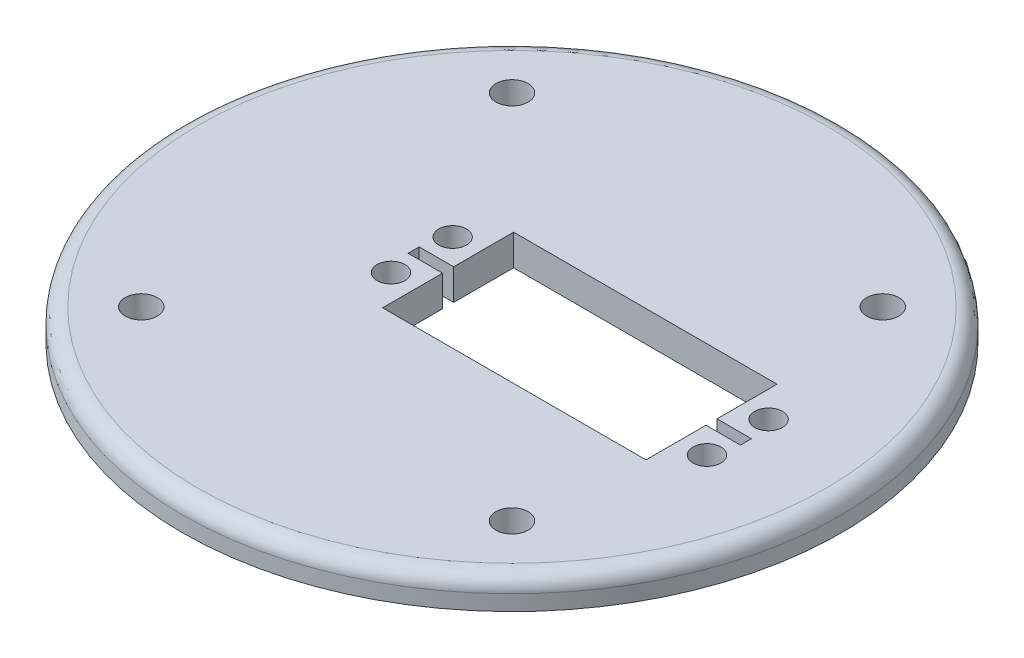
ISO-10303-21;
HEADER;
FILE_DESCRIPTION(('STEP AP214'),'2;1');
FILE_NAME('part.step','',(''),(''),'','','');
FILE_SCHEMA(('AUTOMOTIVE_DESIGN { 1 0 10303 214 1 1 1 1 }'));
ENDSEC;
DATA;
#1=APPLICATION_CONTEXT('core data for automotive mechanical design processes');
#2=APPLICATION_PROTOCOL_DEFINITION('international standard','automotive_design',2000,#1);
#3=PRODUCT_CONTEXT('',#1,'mechanical');
#4=PRODUCT('Part','Part','',(#3));
#5=PRODUCT_RELATED_PRODUCT_CATEGORY('part','',(#4));
#6=PRODUCT_DEFINITION_FORMATION('','',#4);
#7=PRODUCT_DEFINITION_CONTEXT('part definition',#1,'design');
#8=PRODUCT_DEFINITION('design','',#6,#7);
#9=PRODUCT_DEFINITION_SHAPE('','',#8);
#10=(LENGTH_UNIT() NAMED_UNIT(*) SI_UNIT(.MILLI.,.METRE.));
#11=(NAMED_UNIT(*) PLANE_ANGLE_UNIT() SI_UNIT($,.RADIAN.));
#12=(NAMED_UNIT(*) SI_UNIT($,.STERADIAN.) SOLID_ANGLE_UNIT());
#13=UNCERTAINTY_MEASURE_WITH_UNIT(LENGTH_MEASURE(1.E-05),#10,'distance_accuracy_value','');
#14=(GEOMETRIC_REPRESENTATION_CONTEXT(3) GLOBAL_UNCERTAINTY_ASSIGNED_CONTEXT((#13)) GLOBAL_UNIT_ASSIGNED_CONTEXT((#10,
#11,#12)) REPRESENTATION_CONTEXT('',''));
#15=CARTESIAN_POINT('',(0.,0.,0.));
#16=DIRECTION('',(0.,0.,1.));
#17=DIRECTION('',(1.,0.,0.));
#18=AXIS2_PLACEMENT_3D('',#15,#16,#17);
#19=CARTESIAN_POINT('',(34.8,4.7625,4.74999999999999));
#20=DIRECTION('',(0.,-1.,0.));
#21=DIRECTION('',(0.,0.,-1.));
#22=AXIS2_PLACEMENT_3D('',#19,#20,#21);
#23=CYLINDRICAL_SURFACE('',#22,2.15);
#24=CARTESIAN_POINT('',(34.8,4.7625,4.74999999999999));
#25=DIRECTION('',(0.,1.,0.));
#26=DIRECTION('',(0.,0.,1.));
#27=AXIS2_PLACEMENT_3D('',#24,#25,#26);
#28=CIRCLE('',#27,2.15);
#29=CARTESIAN_POINT('',(34.8,4.7625,2.59999999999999));
#30=VERTEX_POINT('',#29);
#31=EDGE_CURVE('E297',#30,#30,#28,.T.);
#32=CARTESIAN_POINT('',(34.8,0.,4.74999999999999));
#33=DIRECTION('',(0.,1.,0.));
#34=DIRECTION('',(0.,0.,1.));
#35=AXIS2_PLACEMENT_3D('',#32,#33,#34);
#36=CIRCLE('',#35,2.15);
#37=CARTESIAN_POINT('',(34.8,0.,2.59999999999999));
#38=VERTEX_POINT('',#37);
#39=EDGE_CURVE('E317',#38,#38,#36,.T.);
#40=CARTESIAN_POINT('',(34.8,4.7625,2.59999999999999));
#41=CARTESIAN_POINT('',(34.8,4.712890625,2.59999999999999));
#42=CARTESIAN_POINT('',(34.8,4.66328125,2.59999999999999));
#43=CARTESIAN_POINT('',(34.8,4.5640625,2.59999999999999));
#44=CARTESIAN_POINT('',(34.8,4.514453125,2.59999999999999));
#45=CARTESIAN_POINT('',(34.8,4.415234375,2.59999999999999));
#46=CARTESIAN_POINT('',(34.8,4.365625,2.59999999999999));
#47=CARTESIAN_POINT('',(34.8,4.26640625,2.59999999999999));
#48=CARTESIAN_POINT('',(34.8,4.216796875,2.59999999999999));
#49=CARTESIAN_POINT('',(34.8,4.117578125,2.59999999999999));
#50=CARTESIAN_POINT('',(34.8,4.06796875,2.59999999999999));
#51=CARTESIAN_POINT('',(34.8,3.96875,2.59999999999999));
#52=CARTESIAN_POINT('',(34.8,3.919140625,2.59999999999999));
#53=CARTESIAN_POINT('',(34.8,3.819921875,2.59999999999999));
#54=CARTESIAN_POINT('',(34.8,3.7703125,2.59999999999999));
#55=CARTESIAN_POINT('',(34.8,3.67109375,2.59999999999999));
#56=CARTESIAN_POINT('',(34.8,3.621484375,2.59999999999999));
#57=CARTESIAN_POINT('',(34.8,3.522265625,2.59999999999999));
#58=CARTESIAN_POINT('',(34.8,3.47265625,2.59999999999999));
#59=CARTESIAN_POINT('',(34.8,3.3734375,2.59999999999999));
#60=CARTESIAN_POINT('',(34.8,3.323828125,2.59999999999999));
#61=CARTESIAN_POINT('',(34.8,3.224609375,2.59999999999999));
#62=CARTESIAN_POINT('',(34.8,3.175,2.59999999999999));
#63=CARTESIAN_POINT('',(34.8,3.07578125,2.59999999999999));
#64=CARTESIAN_POINT('',(34.8,3.026171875,2.59999999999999));
#65=CARTESIAN_POINT('',(34.8,2.926953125,2.59999999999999));
#66=CARTESIAN_POINT('',(34.8,2.87734375,2.59999999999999));
#67=CARTESIAN_POINT('',(34.8,2.778125,2.59999999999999));
#68=CARTESIAN_POINT('',(34.8,2.728515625,2.59999999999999));
#69=CARTESIAN_POINT('',(34.8,2.629296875,2.59999999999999));
#70=CARTESIAN_POINT('',(34.8,2.5796875,2.59999999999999));
#71=CARTESIAN_POINT('',(34.8,2.48046875,2.59999999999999));
#72=CARTESIAN_POINT('',(34.8,2.430859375,2.59999999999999));
#73=CARTESIAN_POINT('',(34.8,2.331640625,2.59999999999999));
#74=CARTESIAN_POINT('',(34.8,2.28203125,2.59999999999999));
#75=CARTESIAN_POINT('',(34.8,2.1828125,2.59999999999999));
#76=CARTESIAN_POINT('',(34.8,2.133203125,2.59999999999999));
#77=CARTESIAN_POINT('',(34.8,2.033984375,2.59999999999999));
#78=CARTESIAN_POINT('',(34.8,1.984375,2.59999999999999));
#79=CARTESIAN_POINT('',(34.8,1.88515625,2.59999999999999));
#80=CARTESIAN_POINT('',(34.8,1.835546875,2.59999999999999));
#81=CARTESIAN_POINT('',(34.8,1.736328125,2.59999999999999));
#82=CARTESIAN_POINT('',(34.8,1.68671875,2.59999999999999));
#83=CARTESIAN_POINT('',(34.8,1.5875,2.59999999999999));
#84=CARTESIAN_POINT('',(34.8,1.537890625,2.59999999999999));
#85=CARTESIAN_POINT('',(34.8,1.438671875,2.59999999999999));
#86=CARTESIAN_POINT('',(34.8,1.3890625,2.59999999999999));
#87=CARTESIAN_POINT('',(34.8,1.28984375,2.59999999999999));
#88=CARTESIAN_POINT('',(34.8,1.240234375,2.59999999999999));
#89=CARTESIAN_POINT('',(34.8,1.141015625,2.59999999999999));
#90=CARTESIAN_POINT('',(34.8,1.09140625,2.59999999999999));
#91=CARTESIAN_POINT('',(34.8,0.992187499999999,2.59999999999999));
#92=CARTESIAN_POINT('',(34.8,0.942578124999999,2.59999999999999));
#93=CARTESIAN_POINT('',(34.8,0.843359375,2.59999999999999));
#94=CARTESIAN_POINT('',(34.8,0.79375,2.59999999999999));
#95=CARTESIAN_POINT('',(34.8,0.69453125,2.59999999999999));
#96=CARTESIAN_POINT('',(34.8,0.644921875,2.59999999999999));
#97=CARTESIAN_POINT('',(34.8,0.545703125,2.59999999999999));
#98=CARTESIAN_POINT('',(34.8,0.49609375,2.59999999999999));
#99=CARTESIAN_POINT('',(34.8,0.396875,2.59999999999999));
#100=CARTESIAN_POINT('',(34.8,0.347265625,2.59999999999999));
#101=CARTESIAN_POINT('',(34.8,0.248046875,2.59999999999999));
#102=CARTESIAN_POINT('',(34.8,0.1984375,2.59999999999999));
#103=CARTESIAN_POINT('',(34.8,0.09921875,2.59999999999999));
#104=CARTESIAN_POINT('',(34.8,0.049609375,2.59999999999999));
#105=CARTESIAN_POINT('',(34.8,0.,2.59999999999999));
#106=B_SPLINE_CURVE_WITH_KNOTS('',3,(#40,#41,#42,#43,#44,#45,#46,#47,#48,#49,#50,#51,#52,#53,
#54,#55,#56,#57,#58,#59,#60,#61,#62,#63,#64,#65,#66,#67,#68,#69,#70,#71,#72,#73,#74,#75,#76,#77,
#78,#79,#80,#81,#82,#83,#84,#85,#86,#87,#88,#89,#90,#91,#92,#93,#94,#95,#96,#97,#98,#99,#100,
#101,#102,#103,#104,#105),.UNSPECIFIED.,.F.,.F.,(4,2,2,2,2,2,2,2,2,2,2,2,2,2,2,2,2,2,2,2,2,2,2,
2,2,2,2,2,2,2,2,2,4),(0.,0.148828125,0.29765625,0.446484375,0.5953125,0.744140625,
0.892968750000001,1.041796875,1.190625,1.339453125,1.48828125,1.637109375,1.7859375,1.934765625,
2.08359375,2.232421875,2.38125,2.530078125,2.67890625,2.827734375,2.9765625,3.125390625,
3.27421875,3.423046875,3.571875,3.720703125,3.86953125,4.018359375,4.1671875,4.316015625,
4.46484375,4.613671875,4.7625),.UNSPECIFIED.);
#107=EDGE_CURVE('BSEAM42',#30,#38,#106,.T.);
#108=ORIENTED_EDGE('',*,*,#31,.T.);
#109=ORIENTED_EDGE('',*,*,#39,.F.);
#110=ORIENTED_EDGE('',*,*,#107,.T.);
#111=ORIENTED_EDGE('',*,*,#107,.F.);
#112=EDGE_LOOP('',(#108,#110,#109,#111));
#113=FACE_BOUND('',#112,.T.);
#114=ADVANCED_FACE('F42',(#113),#23,.F.);
#115=CARTESIAN_POINT('',(0.,4.7625,0.));
#116=DIRECTION('',(0.,-1.,0.));
#117=DIRECTION('',(0.,0.,-1.));
#118=AXIS2_PLACEMENT_3D('',#115,#116,#117);
#119=CYLINDRICAL_SURFACE('',#118,50.8);
#120=CARTESIAN_POINT('',(0.,2.38125,0.));
#121=DIRECTION('',(0.,1.,0.));
#122=DIRECTION('',(0.,0.,1.));
#123=AXIS2_PLACEMENT_3D('',#120,#121,#122);
#124=CIRCLE('',#123,50.8);
#125=CARTESIAN_POINT('',(0.,2.38125,-50.8));
#126=VERTEX_POINT('',#125);
#127=EDGE_CURVE('E327',#126,#126,#124,.F.);
#128=CARTESIAN_POINT('',(0.,0.,0.));
#129=DIRECTION('',(0.,1.,0.));
#130=DIRECTION('',(0.,0.,1.));
#131=AXIS2_PLACEMENT_3D('',#128,#129,#130);
#132=CIRCLE('',#131,50.8);
#133=CARTESIAN_POINT('',(0.,0.,-50.8));
#134=VERTEX_POINT('',#133);
#135=EDGE_CURVE('E313',#134,#134,#132,.T.);
#136=CARTESIAN_POINT('',(0.,2.38125,-50.8));
#137=CARTESIAN_POINT('',(0.,2.3564453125,-50.8));
#138=CARTESIAN_POINT('',(0.,2.331640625,-50.8));
#139=CARTESIAN_POINT('',(0.,2.28203125,-50.8));
#140=CARTESIAN_POINT('',(0.,2.2572265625,-50.8));
#141=CARTESIAN_POINT('',(0.,2.2076171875,-50.8));
#142=CARTESIAN_POINT('',(0.,2.1828125,-50.8));
#143=CARTESIAN_POINT('',(0.,2.133203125,-50.8));
#144=CARTESIAN_POINT('',(0.,2.1083984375,-50.8));
#145=CARTESIAN_POINT('',(0.,2.0587890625,-50.8));
#146=CARTESIAN_POINT('',(0.,2.033984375,-50.8));
#147=CARTESIAN_POINT('',(0.,1.984375,-50.8));
#148=CARTESIAN_POINT('',(0.,1.9595703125,-50.8));
#149=CARTESIAN_POINT('',(0.,1.9099609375,-50.8));
#150=CARTESIAN_POINT('',(0.,1.88515625,-50.8));
#151=CARTESIAN_POINT('',(0.,1.835546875,-50.8));
#152=CARTESIAN_POINT('',(0.,1.8107421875,-50.8));
#153=CARTESIAN_POINT('',(0.,1.7611328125,-50.8));
#154=CARTESIAN_POINT('',(0.,1.736328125,-50.8));
#155=CARTESIAN_POINT('',(0.,1.68671875,-50.8));
#156=CARTESIAN_POINT('',(0.,1.6619140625,-50.8));
#157=CARTESIAN_POINT('',(0.,1.6123046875,-50.8));
#158=CARTESIAN_POINT('',(0.,1.5875,-50.8));
#159=CARTESIAN_POINT('',(0.,1.537890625,-50.8));
#160=CARTESIAN_POINT('',(0.,1.5130859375,-50.8));
#161=CARTESIAN_POINT('',(0.,1.4634765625,-50.8));
#162=CARTESIAN_POINT('',(0.,1.438671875,-50.8));
#163=CARTESIAN_POINT('',(0.,1.3890625,-50.8));
#164=CARTESIAN_POINT('',(0.,1.3642578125,-50.8));
#165=CARTESIAN_POINT('',(0.,1.3146484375,-50.8));
#166=CARTESIAN_POINT('',(0.,1.28984375,-50.8));
#167=CARTESIAN_POINT('',(0.,1.240234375,-50.8));
#168=CARTESIAN_POINT('',(0.,1.2154296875,-50.8));
#169=CARTESIAN_POINT('',(0.,1.1658203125,-50.8));
#170=CARTESIAN_POINT('',(0.,1.141015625,-50.8));
#171=CARTESIAN_POINT('',(0.,1.09140625,-50.8));
#172=CARTESIAN_POINT('',(0.,1.0666015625,-50.8));
#173=CARTESIAN_POINT('',(0.,1.0169921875,-50.8));
#174=CARTESIAN_POINT('',(0.,0.9921875,-50.8));
#175=CARTESIAN_POINT('',(0.,0.942578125,-50.8));
#176=CARTESIAN_POINT('',(0.,0.9177734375,-50.8));
#177=CARTESIAN_POINT('',(0.,0.8681640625,-50.8));
#178=CARTESIAN_POINT('',(0.,0.843359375,-50.8));
#179=CARTESIAN_POINT('',(0.,0.793750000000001,-50.8));
#180=CARTESIAN_POINT('',(0.,0.7689453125,-50.8));
#181=CARTESIAN_POINT('',(0.,0.7193359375,-50.8));
#182=CARTESIAN_POINT('',(0.,0.69453125,-50.8));
#183=CARTESIAN_POINT('',(0.,0.644921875,-50.8));
#184=CARTESIAN_POINT('',(0.,0.6201171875,-50.8));
#185=CARTESIAN_POINT('',(0.,0.5705078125,-50.8));
#186=CARTESIAN_POINT('',(0.,0.545703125,-50.8));
#187=CARTESIAN_POINT('',(0.,0.49609375,-50.8));
#188=CARTESIAN_POINT('',(0.,0.4712890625,-50.8));
#189=CARTESIAN_POINT('',(0.,0.4216796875,-50.8));
#190=CARTESIAN_POINT('',(0.,0.396875,-50.8));
#191=CARTESIAN_POINT('',(0.,0.347265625,-50.8));
#192=CARTESIAN_POINT('',(0.,0.3224609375,-50.8));
#193=CARTESIAN_POINT('',(0.,0.2728515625,-50.8));
#194=CARTESIAN_POINT('',(0.,0.248046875,-50.8));
#195=CARTESIAN_POINT('',(0.,0.1984375,-50.8));
#196=CARTESIAN_POINT('',(0.,0.1736328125,-50.8));
#197=CARTESIAN_POINT('',(0.,0.1240234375,-50.8));
#198=CARTESIAN_POINT('',(0.,0.0992187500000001,-50.8));
#199=CARTESIAN_POINT('',(0.,0.049609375,-50.8));
#200=CARTESIAN_POINT('',(0.,0.0248046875,-50.8));
#201=CARTESIAN_POINT('',(0.,0.,-50.8));
#202=B_SPLINE_CURVE_WITH_KNOTS('',3,(#136,#137,#138,#139,#140,#141,#142,#143,#144,#145,#146,
#147,#148,#149,#150,#151,#152,#153,#154,#155,#156,#157,#158,#159,#160,#161,#162,#163,#164,#165,
#166,#167,#168,#169,#170,#171,#172,#173,#174,#175,#176,#177,#178,#179,#180,#181,#182,#183,#184,
#185,#186,#187,#188,#189,#190,#191,#192,#193,#194,#195,#196,#197,#198,#199,#200,#201),
.UNSPECIFIED.,.F.,.F.,(4,2,2,2,2,2,2,2,2,2,2,2,2,2,2,2,2,2,2,2,2,2,2,2,2,2,2,2,2,2,2,2,4),(0.,
0.0744140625,0.148828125,0.2232421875,0.29765625,0.3720703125,0.446484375,0.5208984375,
0.5953125,0.6697265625,0.744140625,0.8185546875,0.89296875,0.9673828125,1.041796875,
1.1162109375,1.190625,1.2650390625,1.339453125,1.4138671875,1.48828125,1.5626953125,1.637109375,
1.7115234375,1.7859375,1.8603515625,1.934765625,2.0091796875,2.08359375,2.1580078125,
2.232421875,2.3068359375,2.38125),.UNSPECIFIED.);
#203=EDGE_CURVE('BSEAM383',#126,#134,#202,.T.);
#204=ORIENTED_EDGE('',*,*,#127,.T.);
#205=ORIENTED_EDGE('',*,*,#135,.T.);
#206=ORIENTED_EDGE('',*,*,#203,.T.);
#207=ORIENTED_EDGE('',*,*,#203,.F.);
#208=EDGE_LOOP('',(#204,#206,#205,#207));
#209=FACE_BOUND('',#208,.T.);
#210=ADVANCED_FACE('F383',(#209),#119,.T.);
#211=CARTESIAN_POINT('',(-13.9,4.7625,-4.75));
#212=DIRECTION('',(0.,-1.,0.));
#213=DIRECTION('',(0.,0.,-1.));
#214=AXIS2_PLACEMENT_3D('',#211,#212,#213);
#215=CYLINDRICAL_SURFACE('',#214,2.15);
#216=CARTESIAN_POINT('',(-13.9,4.7625,-4.75));
#217=DIRECTION('',(0.,1.,0.));
#218=DIRECTION('',(0.,0.,1.));
#219=AXIS2_PLACEMENT_3D('',#216,#217,#218);
#220=CIRCLE('',#219,2.15);
#221=CARTESIAN_POINT('',(-13.9,4.7625,-6.9));
#222=VERTEX_POINT('',#221);
#223=EDGE_CURVE('E292',#222,#222,#220,.T.);
#224=CARTESIAN_POINT('',(-13.9,0.,-4.75));
#225=DIRECTION('',(0.,1.,0.));
#226=DIRECTION('',(0.,0.,1.));
#227=AXIS2_PLACEMENT_3D('',#224,#225,#226);
#228=CIRCLE('',#227,2.15);
#229=CARTESIAN_POINT('',(-13.9,0.,-6.9));
#230=VERTEX_POINT('',#229);
#231=EDGE_CURVE('E309',#230,#230,#228,.T.);
#232=CARTESIAN_POINT('',(-13.9,4.7625,-6.9));
#233=CARTESIAN_POINT('',(-13.9,4.712890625,-6.9));
#234=CARTESIAN_POINT('',(-13.9,4.66328125,-6.9));
#235=CARTESIAN_POINT('',(-13.9,4.5640625,-6.9));
#236=CARTESIAN_POINT('',(-13.9,4.514453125,-6.9));
#237=CARTESIAN_POINT('',(-13.9,4.415234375,-6.9));
#238=CARTESIAN_POINT('',(-13.9,4.365625,-6.9));
#239=CARTESIAN_POINT('',(-13.9,4.26640625,-6.9));
#240=CARTESIAN_POINT('',(-13.9,4.216796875,-6.9));
#241=CARTESIAN_POINT('',(-13.9,4.117578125,-6.9));
#242=CARTESIAN_POINT('',(-13.9,4.06796875,-6.9));
#243=CARTESIAN_POINT('',(-13.9,3.96875,-6.9));
#244=CARTESIAN_POINT('',(-13.9,3.919140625,-6.9));
#245=CARTESIAN_POINT('',(-13.9,3.819921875,-6.9));
#246=CARTESIAN_POINT('',(-13.9,3.7703125,-6.9));
#247=CARTESIAN_POINT('',(-13.9,3.67109375,-6.9));
#248=CARTESIAN_POINT('',(-13.9,3.621484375,-6.9));
#249=CARTESIAN_POINT('',(-13.9,3.522265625,-6.9));
#250=CARTESIAN_POINT('',(-13.9,3.47265625,-6.9));
#251=CARTESIAN_POINT('',(-13.9,3.3734375,-6.9));
#252=CARTESIAN_POINT('',(-13.9,3.323828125,-6.9));
#253=CARTESIAN_POINT('',(-13.9,3.224609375,-6.9));
#254=CARTESIAN_POINT('',(-13.9,3.175,-6.9));
#255=CARTESIAN_POINT('',(-13.9,3.07578125,-6.9));
#256=CARTESIAN_POINT('',(-13.9,3.026171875,-6.9));
#257=CARTESIAN_POINT('',(-13.9,2.926953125,-6.9));
#258=CARTESIAN_POINT('',(-13.9,2.87734375,-6.9));
#259=CARTESIAN_POINT('',(-13.9,2.778125,-6.9));
#260=CARTESIAN_POINT('',(-13.9,2.728515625,-6.9));
#261=CARTESIAN_POINT('',(-13.9,2.629296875,-6.9));
#262=CARTESIAN_POINT('',(-13.9,2.5796875,-6.9));
#263=CARTESIAN_POINT('',(-13.9,2.48046875,-6.9));
#264=CARTESIAN_POINT('',(-13.9,2.430859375,-6.9));
#265=CARTESIAN_POINT('',(-13.9,2.331640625,-6.9));
#266=CARTESIAN_POINT('',(-13.9,2.28203125,-6.9));
#267=CARTESIAN_POINT('',(-13.9,2.1828125,-6.9));
#268=CARTESIAN_POINT('',(-13.9,2.133203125,-6.9));
#269=CARTESIAN_POINT('',(-13.9,2.033984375,-6.9));
#270=CARTESIAN_POINT('',(-13.9,1.984375,-6.9));
#271=CARTESIAN_POINT('',(-13.9,1.88515625,-6.9));
#272=CARTESIAN_POINT('',(-13.9,1.835546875,-6.9));
#273=CARTESIAN_POINT('',(-13.9,1.736328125,-6.9));
#274=CARTESIAN_POINT('',(-13.9,1.68671875,-6.9));
#275=CARTESIAN_POINT('',(-13.9,1.5875,-6.9));
#276=CARTESIAN_POINT('',(-13.9,1.537890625,-6.9));
#277=CARTESIAN_POINT('',(-13.9,1.438671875,-6.9));
#278=CARTESIAN_POINT('',(-13.9,1.3890625,-6.9));
#279=CARTESIAN_POINT('',(-13.9,1.28984375,-6.9));
#280=CARTESIAN_POINT('',(-13.9,1.240234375,-6.9));
#281=CARTESIAN_POINT('',(-13.9,1.141015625,-6.9));
#282=CARTESIAN_POINT('',(-13.9,1.09140625,-6.9));
#283=CARTESIAN_POINT('',(-13.9,0.992187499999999,-6.9));
#284=CARTESIAN_POINT('',(-13.9,0.942578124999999,-6.9));
#285=CARTESIAN_POINT('',(-13.9,0.843359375,-6.9));
#286=CARTESIAN_POINT('',(-13.9,0.79375,-6.9));
#287=CARTESIAN_POINT('',(-13.9,0.69453125,-6.9));
#288=CARTESIAN_POINT('',(-13.9,0.644921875,-6.9));
#289=CARTESIAN_POINT('',(-13.9,0.545703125,-6.9));
#290=CARTESIAN_POINT('',(-13.9,0.49609375,-6.9));
#291=CARTESIAN_POINT('',(-13.9,0.396875,-6.9));
#292=CARTESIAN_POINT('',(-13.9,0.347265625,-6.9));
#293=CARTESIAN_POINT('',(-13.9,0.248046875,-6.9));
#294=CARTESIAN_POINT('',(-13.9,0.1984375,-6.9));
#295=CARTESIAN_POINT('',(-13.9,0.09921875,-6.9));
#296=CARTESIAN_POINT('',(-13.9,0.049609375,-6.9));
#297=CARTESIAN_POINT('',(-13.9,0.,-6.9));
#298=B_SPLINE_CURVE_WITH_KNOTS('',3,(#232,#233,#234,#235,#236,#237,#238,#239,#240,#241,#242,
#243,#244,#245,#246,#247,#248,#249,#250,#251,#252,#253,#254,#255,#256,#257,#258,#259,#260,#261,
#262,#263,#264,#265,#266,#267,#268,#269,#270,#271,#272,#273,#274,#275,#276,#277,#278,#279,#280,
#281,#282,#283,#284,#285,#286,#287,#288,#289,#290,#291,#292,#293,#294,#295,#296,#297),
.UNSPECIFIED.,.F.,.F.,(4,2,2,2,2,2,2,2,2,2,2,2,2,2,2,2,2,2,2,2,2,2,2,2,2,2,2,2,2,2,2,2,4),(0.,
0.148828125,0.29765625,0.446484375,0.5953125,0.744140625,0.892968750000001,1.041796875,1.190625,
1.339453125,1.48828125,1.637109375,1.7859375,1.934765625,2.08359375,2.232421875,2.38125,
2.530078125,2.67890625,2.827734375,2.9765625,3.125390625,3.27421875,3.423046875,3.571875,
3.720703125,3.86953125,4.018359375,4.1671875,4.316015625,4.46484375,4.613671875,4.7625),.UNSPECIFIED.);
#299=EDGE_CURVE('BSEAM389',#222,#230,#298,.T.);
#300=ORIENTED_EDGE('',*,*,#223,.T.);
#301=ORIENTED_EDGE('',*,*,#231,.F.);
#302=ORIENTED_EDGE('',*,*,#299,.T.);
#303=ORIENTED_EDGE('',*,*,#299,.F.);
#304=EDGE_LOOP('',(#300,#302,#301,#303));
#305=FACE_BOUND('',#304,.T.);
#306=ADVANCED_FACE('F389',(#305),#215,.F.);
#307=CARTESIAN_POINT('',(-13.9,4.7625,4.75));
#308=DIRECTION('',(0.,-1.,0.));
#309=DIRECTION('',(0.,0.,-1.));
#310=AXIS2_PLACEMENT_3D('',#307,#308,#309);
#311=CYLINDRICAL_SURFACE('',#310,2.15);
#312=CARTESIAN_POINT('',(-13.9,4.7625,4.75));
#313=DIRECTION('',(0.,1.,0.));
#314=DIRECTION('',(0.,0.,1.));
#315=AXIS2_PLACEMENT_3D('',#312,#313,#314);
#316=CIRCLE('',#315,2.15);
#317=CARTESIAN_POINT('',(-13.9,4.7625,2.6));
#318=VERTEX_POINT('',#317);
#319=EDGE_CURVE('E288',#318,#318,#316,.F.);
#320=CARTESIAN_POINT('',(-13.9,0.,4.75));
#321=DIRECTION('',(0.,1.,0.));
#322=DIRECTION('',(0.,0.,1.));
#323=AXIS2_PLACEMENT_3D('',#320,#321,#322);
#324=CIRCLE('',#323,2.15);
#325=CARTESIAN_POINT('',(-13.9,0.,2.6));
#326=VERTEX_POINT('',#325);
#327=EDGE_CURVE('E260',#326,#326,#324,.F.);
#328=CARTESIAN_POINT('',(-13.9,4.7625,2.6));
#329=CARTESIAN_POINT('',(-13.9,4.712890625,2.6));
#330=CARTESIAN_POINT('',(-13.9,4.66328125,2.6));
#331=CARTESIAN_POINT('',(-13.9,4.5640625,2.6));
#332=CARTESIAN_POINT('',(-13.9,4.514453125,2.6));
#333=CARTESIAN_POINT('',(-13.9,4.415234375,2.6));
#334=CARTESIAN_POINT('',(-13.9,4.365625,2.6));
#335=CARTESIAN_POINT('',(-13.9,4.26640625,2.6));
#336=CARTESIAN_POINT('',(-13.9,4.216796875,2.6));
#337=CARTESIAN_POINT('',(-13.9,4.117578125,2.6));
#338=CARTESIAN_POINT('',(-13.9,4.06796875,2.6));
#339=CARTESIAN_POINT('',(-13.9,3.96875,2.6));
#340=CARTESIAN_POINT('',(-13.9,3.919140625,2.6));
#341=CARTESIAN_POINT('',(-13.9,3.819921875,2.6));
#342=CARTESIAN_POINT('',(-13.9,3.7703125,2.6));
#343=CARTESIAN_POINT('',(-13.9,3.67109375,2.6));
#344=CARTESIAN_POINT('',(-13.9,3.621484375,2.6));
#345=CARTESIAN_POINT('',(-13.9,3.522265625,2.6));
#346=CARTESIAN_POINT('',(-13.9,3.47265625,2.6));
#347=CARTESIAN_POINT('',(-13.9,3.3734375,2.6));
#348=CARTESIAN_POINT('',(-13.9,3.323828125,2.6));
#349=CARTESIAN_POINT('',(-13.9,3.224609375,2.6));
#350=CARTESIAN_POINT('',(-13.9,3.175,2.6));
#351=CARTESIAN_POINT('',(-13.9,3.07578125,2.6));
#352=CARTESIAN_POINT('',(-13.9,3.026171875,2.6));
#353=CARTESIAN_POINT('',(-13.9,2.926953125,2.6));
#354=CARTESIAN_POINT('',(-13.9,2.87734375,2.6));
#355=CARTESIAN_POINT('',(-13.9,2.778125,2.6));
#356=CARTESIAN_POINT('',(-13.9,2.728515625,2.6));
#357=CARTESIAN_POINT('',(-13.9,2.629296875,2.6));
#358=CARTESIAN_POINT('',(-13.9,2.5796875,2.6));
#359=CARTESIAN_POINT('',(-13.9,2.48046875,2.6));
#360=CARTESIAN_POINT('',(-13.9,2.430859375,2.6));
#361=CARTESIAN_POINT('',(-13.9,2.331640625,2.6));
#362=CARTESIAN_POINT('',(-13.9,2.28203125,2.6));
#363=CARTESIAN_POINT('',(-13.9,2.1828125,2.6));
#364=CARTESIAN_POINT('',(-13.9,2.133203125,2.6));
#365=CARTESIAN_POINT('',(-13.9,2.033984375,2.6));
#366=CARTESIAN_POINT('',(-13.9,1.984375,2.6));
#367=CARTESIAN_POINT('',(-13.9,1.88515625,2.6));
#368=CARTESIAN_POINT('',(-13.9,1.835546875,2.6));
#369=CARTESIAN_POINT('',(-13.9,1.736328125,2.6));
#370=CARTESIAN_POINT('',(-13.9,1.68671875,2.6));
#371=CARTESIAN_POINT('',(-13.9,1.5875,2.6));
#372=CARTESIAN_POINT('',(-13.9,1.537890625,2.6));
#373=CARTESIAN_POINT('',(-13.9,1.438671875,2.6));
#374=CARTESIAN_POINT('',(-13.9,1.3890625,2.6));
#375=CARTESIAN_POINT('',(-13.9,1.28984375,2.6));
#376=CARTESIAN_POINT('',(-13.9,1.240234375,2.6));
#377=CARTESIAN_POINT('',(-13.9,1.141015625,2.6));
#378=CARTESIAN_POINT('',(-13.9,1.09140625,2.6));
#379=CARTESIAN_POINT('',(-13.9,0.992187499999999,2.6));
#380=CARTESIAN_POINT('',(-13.9,0.942578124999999,2.6));
#381=CARTESIAN_POINT('',(-13.9,0.843359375,2.6));
#382=CARTESIAN_POINT('',(-13.9,0.79375,2.6));
#383=CARTESIAN_POINT('',(-13.9,0.69453125,2.6));
#384=CARTESIAN_POINT('',(-13.9,0.644921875,2.6));
#385=CARTESIAN_POINT('',(-13.9,0.545703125,2.6));
#386=CARTESIAN_POINT('',(-13.9,0.49609375,2.6));
#387=CARTESIAN_POINT('',(-13.9,0.396875,2.6));
#388=CARTESIAN_POINT('',(-13.9,0.347265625,2.6));
#389=CARTESIAN_POINT('',(-13.9,0.248046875,2.6));
#390=CARTESIAN_POINT('',(-13.9,0.1984375,2.6));
#391=CARTESIAN_POINT('',(-13.9,0.09921875,2.6));
#392=CARTESIAN_POINT('',(-13.9,0.049609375,2.6));
#393=CARTESIAN_POINT('',(-13.9,0.,2.6));
#394=B_SPLINE_CURVE_WITH_KNOTS('',3,(#328,#329,#330,#331,#332,#333,#334,#335,#336,#337,#338,
#339,#340,#341,#342,#343,#344,#345,#346,#347,#348,#349,#350,#351,#352,#353,#354,#355,#356,#357,
#358,#359,#360,#361,#362,#363,#364,#365,#366,#367,#368,#369,#370,#371,#372,#373,#374,#375,#376,
#377,#378,#379,#380,#381,#382,#383,#384,#385,#386,#387,#388,#389,#390,#391,#392,#393),
.UNSPECIFIED.,.F.,.F.,(4,2,2,2,2,2,2,2,2,2,2,2,2,2,2,2,2,2,2,2,2,2,2,2,2,2,2,2,2,2,2,2,4),(0.,
0.148828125,0.29765625,0.446484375,0.5953125,0.744140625,0.892968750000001,1.041796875,1.190625,
1.339453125,1.48828125,1.637109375,1.7859375,1.934765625,2.08359375,2.232421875,2.38125,
2.530078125,2.67890625,2.827734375,2.9765625,3.125390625,3.27421875,3.423046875,3.571875,
3.720703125,3.86953125,4.018359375,4.1671875,4.316015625,4.46484375,4.613671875,4.7625),.UNSPECIFIED.);
#395=EDGE_CURVE('BSEAM398',#318,#326,#394,.T.);
#396=ORIENTED_EDGE('',*,*,#319,.F.);
#397=ORIENTED_EDGE('',*,*,#327,.T.);
#398=ORIENTED_EDGE('',*,*,#395,.T.);
#399=ORIENTED_EDGE('',*,*,#395,.F.);
#400=EDGE_LOOP('',(#396,#398,#397,#399));
#401=FACE_BOUND('',#400,.T.);
#402=ADVANCED_FACE('F398',(#401),#311,.F.);
#403=CARTESIAN_POINT('',(34.8,4.7625,-4.75000000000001));
#404=DIRECTION('',(0.,-1.,0.));
#405=DIRECTION('',(0.,0.,-1.));
#406=AXIS2_PLACEMENT_3D('',#403,#404,#405);
#407=CYLINDRICAL_SURFACE('',#406,2.15000000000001);
#408=CARTESIAN_POINT('',(34.8,4.7625,-4.75000000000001));
#409=DIRECTION('',(0.,1.,0.));
#410=DIRECTION('',(0.,0.,1.));
#411=AXIS2_PLACEMENT_3D('',#408,#409,#410);
#412=CIRCLE('',#411,2.15000000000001);
#413=CARTESIAN_POINT('',(34.8,4.7625,-6.90000000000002));
#414=VERTEX_POINT('',#413);
#415=EDGE_CURVE('E301',#414,#414,#412,.F.);
#416=CARTESIAN_POINT('',(34.8,0.,-4.75000000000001));
#417=DIRECTION('',(0.,1.,0.));
#418=DIRECTION('',(0.,0.,1.));
#419=AXIS2_PLACEMENT_3D('',#416,#417,#418);
#420=CIRCLE('',#419,2.15000000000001);
#421=CARTESIAN_POINT('',(34.8,0.,-6.90000000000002));
#422=VERTEX_POINT('',#421);
#423=EDGE_CURVE('E293',#422,#422,#420,.F.);
#424=CARTESIAN_POINT('',(34.8,4.7625,-6.90000000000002));
#425=CARTESIAN_POINT('',(34.8,4.712890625,-6.90000000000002));
#426=CARTESIAN_POINT('',(34.8,4.66328125,-6.90000000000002));
#427=CARTESIAN_POINT('',(34.8,4.5640625,-6.90000000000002));
#428=CARTESIAN_POINT('',(34.8,4.514453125,-6.90000000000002));
#429=CARTESIAN_POINT('',(34.8,4.415234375,-6.90000000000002));
#430=CARTESIAN_POINT('',(34.8,4.365625,-6.90000000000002));
#431=CARTESIAN_POINT('',(34.8,4.26640625,-6.90000000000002));
#432=CARTESIAN_POINT('',(34.8,4.216796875,-6.90000000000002));
#433=CARTESIAN_POINT('',(34.8,4.117578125,-6.90000000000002));
#434=CARTESIAN_POINT('',(34.8,4.06796875,-6.90000000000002));
#435=CARTESIAN_POINT('',(34.8,3.96875,-6.90000000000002));
#436=CARTESIAN_POINT('',(34.8,3.919140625,-6.90000000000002));
#437=CARTESIAN_POINT('',(34.8,3.819921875,-6.90000000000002));
#438=CARTESIAN_POINT('',(34.8,3.7703125,-6.90000000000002));
#439=CARTESIAN_POINT('',(34.8,3.67109375,-6.90000000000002));
#440=CARTESIAN_POINT('',(34.8,3.621484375,-6.90000000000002));
#441=CARTESIAN_POINT('',(34.8,3.522265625,-6.90000000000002));
#442=CARTESIAN_POINT('',(34.8,3.47265625,-6.90000000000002));
#443=CARTESIAN_POINT('',(34.8,3.3734375,-6.90000000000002));
#444=CARTESIAN_POINT('',(34.8,3.323828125,-6.90000000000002));
#445=CARTESIAN_POINT('',(34.8,3.224609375,-6.90000000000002));
#446=CARTESIAN_POINT('',(34.8,3.175,-6.90000000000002));
#447=CARTESIAN_POINT('',(34.8,3.07578125,-6.90000000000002));
#448=CARTESIAN_POINT('',(34.8,3.026171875,-6.90000000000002));
#449=CARTESIAN_POINT('',(34.8,2.926953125,-6.90000000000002));
#450=CARTESIAN_POINT('',(34.8,2.87734375,-6.90000000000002));
#451=CARTESIAN_POINT('',(34.8,2.778125,-6.90000000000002));
#452=CARTESIAN_POINT('',(34.8,2.728515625,-6.90000000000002));
#453=CARTESIAN_POINT('',(34.8,2.629296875,-6.90000000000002));
#454=CARTESIAN_POINT('',(34.8,2.5796875,-6.90000000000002));
#455=CARTESIAN_POINT('',(34.8,2.48046875,-6.90000000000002));
#456=CARTESIAN_POINT('',(34.8,2.430859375,-6.90000000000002));
#457=CARTESIAN_POINT('',(34.8,2.331640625,-6.90000000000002));
#458=CARTESIAN_POINT('',(34.8,2.28203125,-6.90000000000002));
#459=CARTESIAN_POINT('',(34.8,2.1828125,-6.90000000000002));
#460=CARTESIAN_POINT('',(34.8,2.133203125,-6.90000000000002));
#461=CARTESIAN_POINT('',(34.8,2.033984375,-6.90000000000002));
#462=CARTESIAN_POINT('',(34.8,1.984375,-6.90000000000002));
#463=CARTESIAN_POINT('',(34.8,1.88515625,-6.90000000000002));
#464=CARTESIAN_POINT('',(34.8,1.835546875,-6.90000000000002));
#465=CARTESIAN_POINT('',(34.8,1.736328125,-6.90000000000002));
#466=CARTESIAN_POINT('',(34.8,1.68671875,-6.90000000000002));
#467=CARTESIAN_POINT('',(34.8,1.5875,-6.90000000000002));
#468=CARTESIAN_POINT('',(34.8,1.537890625,-6.90000000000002));
#469=CARTESIAN_POINT('',(34.8,1.438671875,-6.90000000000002));
#470=CARTESIAN_POINT('',(34.8,1.3890625,-6.90000000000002));
#471=CARTESIAN_POINT('',(34.8,1.28984375,-6.90000000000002));
#472=CARTESIAN_POINT('',(34.8,1.240234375,-6.90000000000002));
#473=CARTESIAN_POINT('',(34.8,1.141015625,-6.90000000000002));
#474=CARTESIAN_POINT('',(34.8,1.09140625,-6.90000000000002));
#475=CARTESIAN_POINT('',(34.8,0.992187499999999,-6.90000000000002));
#476=CARTESIAN_POINT('',(34.8,0.942578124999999,-6.90000000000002));
#477=CARTESIAN_POINT('',(34.8,0.843359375,-6.90000000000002));
#478=CARTESIAN_POINT('',(34.8,0.79375,-6.90000000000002));
#479=CARTESIAN_POINT('',(34.8,0.69453125,-6.90000000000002));
#480=CARTESIAN_POINT('',(34.8,0.644921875,-6.90000000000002));
#481=CARTESIAN_POINT('',(34.8,0.545703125,-6.90000000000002));
#482=CARTESIAN_POINT('',(34.8,0.49609375,-6.90000000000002));
#483=CARTESIAN_POINT('',(34.8,0.396875,-6.90000000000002));
#484=CARTESIAN_POINT('',(34.8,0.347265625,-6.90000000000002));
#485=CARTESIAN_POINT('',(34.8,0.248046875,-6.90000000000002));
#486=CARTESIAN_POINT('',(34.8,0.1984375,-6.90000000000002));
#487=CARTESIAN_POINT('',(34.8,0.09921875,-6.90000000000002));
#488=CARTESIAN_POINT('',(34.8,0.049609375,-6.90000000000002));
#489=CARTESIAN_POINT('',(34.8,0.,-6.90000000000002));
#490=B_SPLINE_CURVE_WITH_KNOTS('',3,(#424,#425,#426,#427,#428,#429,#430,#431,#432,#433,#434,
#435,#436,#437,#438,#439,#440,#441,#442,#443,#444,#445,#446,#447,#448,#449,#450,#451,#452,#453,
#454,#455,#456,#457,#458,#459,#460,#461,#462,#463,#464,#465,#466,#467,#468,#469,#470,#471,#472,
#473,#474,#475,#476,#477,#478,#479,#480,#481,#482,#483,#484,#485,#486,#487,#488,#489),
.UNSPECIFIED.,.F.,.F.,(4,2,2,2,2,2,2,2,2,2,2,2,2,2,2,2,2,2,2,2,2,2,2,2,2,2,2,2,2,2,2,2,4),(0.,
0.148828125,0.29765625,0.446484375,0.5953125,0.744140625,0.892968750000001,1.041796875,1.190625,
1.339453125,1.48828125,1.637109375,1.7859375,1.934765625,2.08359375,2.232421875,2.38125,
2.530078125,2.67890625,2.827734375,2.9765625,3.125390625,3.27421875,3.423046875,3.571875,
3.720703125,3.86953125,4.018359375,4.1671875,4.316015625,4.46484375,4.613671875,4.7625),.UNSPECIFIED.);
#491=EDGE_CURVE('BSEAM394',#414,#422,#490,.T.);
#492=ORIENTED_EDGE('',*,*,#415,.F.);
#493=ORIENTED_EDGE('',*,*,#423,.T.);
#494=ORIENTED_EDGE('',*,*,#491,.T.);
#495=ORIENTED_EDGE('',*,*,#491,.F.);
#496=EDGE_LOOP('',(#492,#494,#493,#495));
#497=FACE_BOUND('',#496,.T.);
#498=ADVANCED_FACE('F394',(#497),#407,.F.);
#499=CARTESIAN_POINT('',(0.,4.7625,0.));
#500=DIRECTION('',(0.,1.,0.));
#501=DIRECTION('',(0.,0.,1.));
#502=AXIS2_PLACEMENT_3D('',#499,#500,#501);
#503=PLANE('',#502);
#504=DIRECTION('',(0.,0.,-1.));
#505=VECTOR('',#504,1.);
#506=CARTESIAN_POINT('',(30.75,4.7625,-10.1));
#507=LINE('',#506,#505);
#508=CARTESIAN_POINT('',(30.75,4.7625,10.1));
#509=VERTEX_POINT('',#508);
#510=CARTESIAN_POINT('',(30.75,4.7625,0.849999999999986));
#511=VERTEX_POINT('',#510);
#512=EDGE_CURVE('E176',#509,#511,#507,.T.);
#513=ORIENTED_EDGE('',*,*,#512,.F.);
#514=DIRECTION('',(1.,0.,0.));
#515=VECTOR('',#514,1.);
#516=CARTESIAN_POINT('',(-9.85,4.7625,10.1));
#517=LINE('',#516,#515);
#518=CARTESIAN_POINT('',(-9.85,4.7625,10.1));
#519=VERTEX_POINT('',#518);
#520=EDGE_CURVE('E163',#519,#509,#517,.T.);
#521=ORIENTED_EDGE('',*,*,#520,.F.);
#522=DIRECTION('',(0.,0.,1.));
#523=VECTOR('',#522,1.);
#524=CARTESIAN_POINT('',(-9.85,4.7625,-10.1));
#525=LINE('',#524,#523);
#526=CARTESIAN_POINT('',(-9.85,4.7625,0.85));
#527=VERTEX_POINT('',#526);
#528=EDGE_CURVE('E182',#527,#519,#525,.T.);
#529=ORIENTED_EDGE('',*,*,#528,.F.);
#530=DIRECTION('',(1.,0.,0.));
#531=VECTOR('',#530,1.);
#532=CARTESIAN_POINT('',(-15.16,4.7625,0.849999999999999));
#533=LINE('',#532,#531);
#534=CARTESIAN_POINT('',(-15.16,4.7625,0.849999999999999));
#535=VERTEX_POINT('',#534);
#536=EDGE_CURVE('E237',#535,#527,#533,.T.);
#537=ORIENTED_EDGE('',*,*,#536,.F.);
#538=DIRECTION('',(0.,0.,1.));
#539=VECTOR('',#538,1.);
#540=CARTESIAN_POINT('',(-15.16,4.7625,-0.849999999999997));
#541=LINE('',#540,#539);
#542=CARTESIAN_POINT('',(-15.16,4.7625,-0.849999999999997));
#543=VERTEX_POINT('',#542);
#544=EDGE_CURVE('E249',#543,#535,#541,.T.);
#545=ORIENTED_EDGE('',*,*,#544,.F.);
#546=DIRECTION('',(-1.,0.,0.));
#547=VECTOR('',#546,1.);
#548=CARTESIAN_POINT('',(-15.16,4.7625,-0.849999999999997));
#549=LINE('',#548,#547);
#550=CARTESIAN_POINT('',(-9.85,4.7625,-0.85));
#551=VERTEX_POINT('',#550);
#552=EDGE_CURVE('E246',#551,#543,#549,.T.);
#553=ORIENTED_EDGE('',*,*,#552,.F.);
#554=CARTESIAN_POINT('',(-9.85,4.7625,-10.1));
#555=VERTEX_POINT('',#554);
#556=EDGE_CURVE('E66',#555,#551,#525,.T.);
#557=ORIENTED_EDGE('',*,*,#556,.F.);
#558=DIRECTION('',(-1.,0.,0.));
#559=VECTOR('',#558,1.);
#560=CARTESIAN_POINT('',(-9.85,4.7625,-10.1));
#561=LINE('',#560,#559);
#562=CARTESIAN_POINT('',(30.75,4.7625,-10.1));
#563=VERTEX_POINT('',#562);
#564=EDGE_CURVE('E179',#563,#555,#561,.T.);
#565=ORIENTED_EDGE('',*,*,#564,.F.);
#566=CARTESIAN_POINT('',(30.75,4.7625,-0.850000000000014));
#567=VERTEX_POINT('',#566);
#568=EDGE_CURVE('E138',#567,#563,#507,.T.);
#569=ORIENTED_EDGE('',*,*,#568,.F.);
#570=DIRECTION('',(-1.,0.,0.));
#571=VECTOR('',#570,1.);
#572=CARTESIAN_POINT('',(36.06,4.7625,-0.850000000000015));
#573=LINE('',#572,#571);
#574=CARTESIAN_POINT('',(36.06,4.7625,-0.850000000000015));
#575=VERTEX_POINT('',#574);
#576=EDGE_CURVE('E250',#575,#567,#573,.T.);
#577=ORIENTED_EDGE('',*,*,#576,.F.);
#578=DIRECTION('',(0.,0.,-1.));
#579=VECTOR('',#578,1.);
#580=CARTESIAN_POINT('',(36.06,4.7625,-0.850000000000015));
#581=LINE('',#580,#579);
#582=CARTESIAN_POINT('',(36.06,4.7625,0.849999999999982));
#583=VERTEX_POINT('',#582);
#584=EDGE_CURVE('E271',#583,#575,#581,.T.);
#585=ORIENTED_EDGE('',*,*,#584,.F.);
#586=DIRECTION('',(1.,0.,0.));
#587=VECTOR('',#586,1.);
#588=CARTESIAN_POINT('',(36.06,4.7625,0.849999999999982));
#589=LINE('',#588,#587);
#590=EDGE_CURVE('E275',#511,#583,#589,.T.);
#591=ORIENTED_EDGE('',*,*,#590,.F.);
#592=EDGE_LOOP('',(#513,#521,#529,#537,#545,#553,#557,#565,#569,#577,#585,#591));
#593=FACE_BOUND('',#592,.T.);
#594=CARTESIAN_POINT('',(0.,4.7625,0.));
#595=DIRECTION('',(0.,1.,0.));
#596=DIRECTION('',(0.,0.,1.));
#597=AXIS2_PLACEMENT_3D('',#594,#595,#596);
#598=CIRCLE('',#597,48.41875);
#599=CARTESIAN_POINT('',(0.,4.7625,48.41875));
#600=VERTEX_POINT('',#599);
#601=EDGE_CURVE('E305',#600,#600,#598,.T.);
#602=ORIENTED_EDGE('',*,*,#601,.T.);
#603=EDGE_LOOP('',(#602));
#604=FACE_BOUND('',#603,.T.);
#605=CARTESIAN_POINT('',(28.575,4.7625,-28.575));
#606=DIRECTION('',(0.,1.,0.));
#607=DIRECTION('',(0.,0.,1.));
#608=AXIS2_PLACEMENT_3D('',#605,#606,#607);
#609=CIRCLE('',#608,2.48125);
#610=CARTESIAN_POINT('',(28.575,4.7625,-26.09375));
#611=VERTEX_POINT('',#610);
#612=EDGE_CURVE('E209',#611,#611,#609,.T.);
#613=ORIENTED_EDGE('',*,*,#612,.F.);
#614=EDGE_LOOP('',(#613));
#615=FACE_BOUND('',#614,.T.);
#616=CARTESIAN_POINT('',(-28.575,4.7625,28.575));
#617=DIRECTION('',(0.,1.,0.));
#618=DIRECTION('',(0.,0.,1.));
#619=AXIS2_PLACEMENT_3D('',#616,#617,#618);
#620=CIRCLE('',#619,2.48125);
#621=CARTESIAN_POINT('',(-28.575,4.7625,31.05625));
#622=VERTEX_POINT('',#621);
#623=EDGE_CURVE('E218',#622,#622,#620,.T.);
#624=ORIENTED_EDGE('',*,*,#623,.F.);
#625=EDGE_LOOP('',(#624));
#626=FACE_BOUND('',#625,.T.);
#627=CARTESIAN_POINT('',(28.575,4.7625,28.575));
#628=DIRECTION('',(0.,1.,0.));
#629=DIRECTION('',(0.,0.,1.));
#630=AXIS2_PLACEMENT_3D('',#627,#628,#629);
#631=CIRCLE('',#630,2.48125);
#632=CARTESIAN_POINT('',(28.575,4.7625,31.05625));
#633=VERTEX_POINT('',#632);
#634=EDGE_CURVE('E201',#633,#633,#631,.T.);
#635=ORIENTED_EDGE('',*,*,#634,.F.);
#636=EDGE_LOOP('',(#635));
#637=FACE_BOUND('',#636,.T.);
#638=CARTESIAN_POINT('',(-28.575,4.7625,-28.575));
#639=DIRECTION('',(0.,1.,0.));
#640=DIRECTION('',(0.,0.,1.));
#641=AXIS2_PLACEMENT_3D('',#638,#639,#640);
#642=CIRCLE('',#641,2.48125);
#643=CARTESIAN_POINT('',(-28.575,4.7625,-26.09375));
#644=VERTEX_POINT('',#643);
#645=EDGE_CURVE('E213',#644,#644,#642,.T.);
#646=ORIENTED_EDGE('',*,*,#645,.F.);
#647=EDGE_LOOP('',(#646));
#648=FACE_BOUND('',#647,.T.);
#649=ORIENTED_EDGE('',*,*,#319,.T.);
#650=EDGE_LOOP('',(#649));
#651=FACE_BOUND('',#650,.T.);
#652=ORIENTED_EDGE('',*,*,#223,.F.);
#653=EDGE_LOOP('',(#652));
#654=FACE_BOUND('',#653,.T.);
#655=ORIENTED_EDGE('',*,*,#31,.F.);
#656=EDGE_LOOP('',(#655));
#657=FACE_BOUND('',#656,.T.);
#658=ORIENTED_EDGE('',*,*,#415,.T.);
#659=EDGE_LOOP('',(#658));
#660=FACE_BOUND('',#659,.T.);
#661=ADVANCED_FACE('F339',(#593,#604,#615,#626,#637,#648,#651,#654,#657,#660),#503,.T.);
#662=CARTESIAN_POINT('',(0.,0.,0.));
#663=DIRECTION('',(0.,1.,0.));
#664=DIRECTION('',(0.,0.,1.));
#665=AXIS2_PLACEMENT_3D('',#662,#663,#664);
#666=PLANE('',#665);
#667=DIRECTION('',(1.,0.,0.));
#668=VECTOR('',#667,1.);
#669=CARTESIAN_POINT('',(-9.85,0.,10.1));
#670=LINE('',#669,#668);
#671=CARTESIAN_POINT('',(-9.85,0.,10.1));
#672=VERTEX_POINT('',#671);
#673=CARTESIAN_POINT('',(30.75,0.,10.1));
#674=VERTEX_POINT('',#673);
#675=EDGE_CURVE('E144',#672,#674,#670,.T.);
#676=ORIENTED_EDGE('',*,*,#675,.T.);
#677=DIRECTION('',(0.,0.,-1.));
#678=VECTOR('',#677,1.);
#679=CARTESIAN_POINT('',(30.75,0.,-10.1));
#680=LINE('',#679,#678);
#681=CARTESIAN_POINT('',(30.75,0.,0.849999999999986));
#682=VERTEX_POINT('',#681);
#683=EDGE_CURVE('E153',#674,#682,#680,.T.);
#684=ORIENTED_EDGE('',*,*,#683,.T.);
#685=DIRECTION('',(1.,0.,0.));
#686=VECTOR('',#685,1.);
#687=CARTESIAN_POINT('',(36.06,0.,0.849999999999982));
#688=LINE('',#687,#686);
#689=CARTESIAN_POINT('',(36.06,0.,0.849999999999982));
#690=VERTEX_POINT('',#689);
#691=EDGE_CURVE('E283',#682,#690,#688,.T.);
#692=ORIENTED_EDGE('',*,*,#691,.T.);
#693=DIRECTION('',(0.,0.,-1.));
#694=VECTOR('',#693,1.);
#695=CARTESIAN_POINT('',(36.06,0.,-0.850000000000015));
#696=LINE('',#695,#694);
#697=CARTESIAN_POINT('',(36.06,0.,-0.850000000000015));
#698=VERTEX_POINT('',#697);
#699=EDGE_CURVE('E268',#690,#698,#696,.T.);
#700=ORIENTED_EDGE('',*,*,#699,.T.);
#701=DIRECTION('',(-1.,0.,0.));
#702=VECTOR('',#701,1.);
#703=CARTESIAN_POINT('',(36.06,0.,-0.850000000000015));
#704=LINE('',#703,#702);
#705=CARTESIAN_POINT('',(30.75,0.,-0.850000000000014));
#706=VERTEX_POINT('',#705);
#707=EDGE_CURVE('E161',#698,#706,#704,.T.);
#708=ORIENTED_EDGE('',*,*,#707,.T.);
#709=CARTESIAN_POINT('',(30.75,0.,-10.1));
#710=VERTEX_POINT('',#709);
#711=EDGE_CURVE('E135',#706,#710,#680,.T.);
#712=ORIENTED_EDGE('',*,*,#711,.T.);
#713=DIRECTION('',(-1.,0.,0.));
#714=VECTOR('',#713,1.);
#715=CARTESIAN_POINT('',(-9.85,0.,-10.1));
#716=LINE('',#715,#714);
#717=CARTESIAN_POINT('',(-9.85,0.,-10.1));
#718=VERTEX_POINT('',#717);
#719=EDGE_CURVE('E147',#710,#718,#716,.T.);
#720=ORIENTED_EDGE('',*,*,#719,.T.);
#721=DIRECTION('',(0.,0.,1.));
#722=VECTOR('',#721,1.);
#723=CARTESIAN_POINT('',(-9.85,0.,-10.1));
#724=LINE('',#723,#722);
#725=CARTESIAN_POINT('',(-9.85,0.,-0.85));
#726=VERTEX_POINT('',#725);
#727=EDGE_CURVE('E171',#718,#726,#724,.T.);
#728=ORIENTED_EDGE('',*,*,#727,.T.);
#729=DIRECTION('',(-1.,0.,0.));
#730=VECTOR('',#729,1.);
#731=CARTESIAN_POINT('',(-15.16,0.,-0.849999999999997));
#732=LINE('',#731,#730);
#733=CARTESIAN_POINT('',(-15.16,0.,-0.849999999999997));
#734=VERTEX_POINT('',#733);
#735=EDGE_CURVE('E233',#726,#734,#732,.T.);
#736=ORIENTED_EDGE('',*,*,#735,.T.);
#737=DIRECTION('',(0.,0.,1.));
#738=VECTOR('',#737,1.);
#739=CARTESIAN_POINT('',(-15.16,0.,-0.849999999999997));
#740=LINE('',#739,#738);
#741=CARTESIAN_POINT('',(-15.16,0.,0.849999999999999));
#742=VERTEX_POINT('',#741);
#743=EDGE_CURVE('E236',#734,#742,#740,.T.);
#744=ORIENTED_EDGE('',*,*,#743,.T.);
#745=DIRECTION('',(1.,0.,0.));
#746=VECTOR('',#745,1.);
#747=CARTESIAN_POINT('',(-15.16,0.,0.849999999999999));
#748=LINE('',#747,#746);
#749=CARTESIAN_POINT('',(-9.85,0.,0.85));
#750=VERTEX_POINT('',#749);
#751=EDGE_CURVE('E241',#742,#750,#748,.T.);
#752=ORIENTED_EDGE('',*,*,#751,.T.);
#753=EDGE_CURVE('E58',#750,#672,#724,.T.);
#754=ORIENTED_EDGE('',*,*,#753,.T.);
#755=EDGE_LOOP('',(#676,#684,#692,#700,#708,#712,#720,#728,#736,#744,#752,#754));
#756=FACE_BOUND('',#755,.T.);
#757=CARTESIAN_POINT('',(28.575,0.,-28.575));
#758=DIRECTION('',(0.,1.,0.));
#759=DIRECTION('',(0.,0.,1.));
#760=AXIS2_PLACEMENT_3D('',#757,#758,#759);
#761=CIRCLE('',#760,2.48125);
#762=CARTESIAN_POINT('',(28.575,0.,-26.09375));
#763=VERTEX_POINT('',#762);
#764=EDGE_CURVE('E214',#763,#763,#761,.T.);
#765=ORIENTED_EDGE('',*,*,#764,.T.);
#766=EDGE_LOOP('',(#765));
#767=FACE_BOUND('',#766,.T.);
#768=CARTESIAN_POINT('',(-28.575,0.,28.575));
#769=DIRECTION('',(0.,1.,0.));
#770=DIRECTION('',(0.,0.,1.));
#771=AXIS2_PLACEMENT_3D('',#768,#769,#770);
#772=CIRCLE('',#771,2.48125);
#773=CARTESIAN_POINT('',(-28.575,0.,31.05625));
#774=VERTEX_POINT('',#773);
#775=EDGE_CURVE('E205',#774,#774,#772,.T.);
#776=ORIENTED_EDGE('',*,*,#775,.T.);
#777=EDGE_LOOP('',(#776));
#778=FACE_BOUND('',#777,.T.);
#779=CARTESIAN_POINT('',(28.575,0.,28.575));
#780=DIRECTION('',(0.,1.,0.));
#781=DIRECTION('',(0.,0.,1.));
#782=AXIS2_PLACEMENT_3D('',#779,#780,#781);
#783=CIRCLE('',#782,2.48125);
#784=CARTESIAN_POINT('',(28.575,0.,31.05625));
#785=VERTEX_POINT('',#784);
#786=EDGE_CURVE('E200',#785,#785,#783,.T.);
#787=ORIENTED_EDGE('',*,*,#786,.T.);
#788=EDGE_LOOP('',(#787));
#789=FACE_BOUND('',#788,.T.);
#790=CARTESIAN_POINT('',(-28.575,0.,-28.575));
#791=DIRECTION('',(0.,1.,0.));
#792=DIRECTION('',(0.,0.,1.));
#793=AXIS2_PLACEMENT_3D('',#790,#791,#792);
#794=CIRCLE('',#793,2.48125);
#795=CARTESIAN_POINT('',(-28.575,0.,-26.09375));
#796=VERTEX_POINT('',#795);
#797=EDGE_CURVE('E225',#796,#796,#794,.T.);
#798=ORIENTED_EDGE('',*,*,#797,.T.);
#799=EDGE_LOOP('',(#798));
#800=FACE_BOUND('',#799,.T.);
#801=ORIENTED_EDGE('',*,*,#327,.F.);
#802=EDGE_LOOP('',(#801));
#803=FACE_BOUND('',#802,.T.);
#804=ORIENTED_EDGE('',*,*,#231,.T.);
#805=EDGE_LOOP('',(#804));
#806=FACE_BOUND('',#805,.T.);
#807=ORIENTED_EDGE('',*,*,#135,.F.);
#808=EDGE_LOOP('',(#807));
#809=FACE_BOUND('',#808,.T.);
#810=ORIENTED_EDGE('',*,*,#39,.T.);
#811=EDGE_LOOP('',(#810));
#812=FACE_BOUND('',#811,.T.);
#813=ORIENTED_EDGE('',*,*,#423,.F.);
#814=EDGE_LOOP('',(#813));
#815=FACE_BOUND('',#814,.T.);
#816=ADVANCED_FACE('F157',(#756,#767,#778,#789,#800,#803,#806,#809,#812,#815),#666,.F.);
#817=CARTESIAN_POINT('',(36.06,0.,-0.850000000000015));
#818=DIRECTION('',(0.,0.,-1.));
#819=DIRECTION('',(-1.,0.,0.));
#820=AXIS2_PLACEMENT_3D('',#817,#818,#819);
#821=PLANE('',#820);
#822=ORIENTED_EDGE('',*,*,#576,.T.);
#823=DIRECTION('',(0.,-1.,0.));
#824=VECTOR('',#823,1.);
#825=CARTESIAN_POINT('',(30.75,0.,-0.850000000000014));
#826=LINE('',#825,#824);
#827=EDGE_CURVE('E197',#567,#706,#826,.T.);
#828=ORIENTED_EDGE('',*,*,#827,.T.);
#829=ORIENTED_EDGE('',*,*,#707,.F.);
#830=DIRECTION('',(0.,1.,0.));
#831=VECTOR('',#830,1.);
#832=CARTESIAN_POINT('',(36.06,0.,-0.850000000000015));
#833=LINE('',#832,#831);
#834=EDGE_CURVE('E229',#698,#575,#833,.T.);
#835=ORIENTED_EDGE('',*,*,#834,.T.);
#836=EDGE_LOOP('',(#822,#828,#829,#835));
#837=FACE_BOUND('',#836,.T.);
#838=ADVANCED_FACE('F352',(#837),#821,.F.);
#839=CARTESIAN_POINT('',(36.06,0.,-0.850000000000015));
#840=DIRECTION('',(1.,0.,0.));
#841=DIRECTION('',(0.,0.,-1.));
#842=AXIS2_PLACEMENT_3D('',#839,#840,#841);
#843=PLANE('',#842);
#844=ORIENTED_EDGE('',*,*,#584,.T.);
#845=ORIENTED_EDGE('',*,*,#834,.F.);
#846=ORIENTED_EDGE('',*,*,#699,.F.);
#847=DIRECTION('',(0.,1.,0.));
#848=VECTOR('',#847,1.);
#849=CARTESIAN_POINT('',(36.06,0.,0.849999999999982));
#850=LINE('',#849,#848);
#851=EDGE_CURVE('E264',#690,#583,#850,.T.);
#852=ORIENTED_EDGE('',*,*,#851,.T.);
#853=EDGE_LOOP('',(#844,#845,#846,#852));
#854=FACE_BOUND('',#853,.T.);
#855=ADVANCED_FACE('F355',(#854),#843,.F.);
#856=CARTESIAN_POINT('',(36.06,0.,0.849999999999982));
#857=DIRECTION('',(0.,0.,1.));
#858=DIRECTION('',(1.,0.,0.));
#859=AXIS2_PLACEMENT_3D('',#856,#857,#858);
#860=PLANE('',#859);
#861=ORIENTED_EDGE('',*,*,#691,.F.);
#862=DIRECTION('',(0.,1.,0.));
#863=VECTOR('',#862,1.);
#864=CARTESIAN_POINT('',(30.75,0.,0.849999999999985));
#865=LINE('',#864,#863);
#866=EDGE_CURVE('E11',#682,#511,#865,.T.);
#867=ORIENTED_EDGE('',*,*,#866,.T.);
#868=ORIENTED_EDGE('',*,*,#590,.T.);
#869=ORIENTED_EDGE('',*,*,#851,.F.);
#870=EDGE_LOOP('',(#861,#867,#868,#869));
#871=FACE_BOUND('',#870,.T.);
#872=ADVANCED_FACE('F361',(#871),#860,.F.);
#873=CARTESIAN_POINT('',(-15.16,0.,0.849999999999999));
#874=DIRECTION('',(0.,0.,1.));
#875=DIRECTION('',(1.,0.,0.));
#876=AXIS2_PLACEMENT_3D('',#873,#874,#875);
#877=PLANE('',#876);
#878=ORIENTED_EDGE('',*,*,#536,.T.);
#879=DIRECTION('',(0.,-1.,0.));
#880=VECTOR('',#879,1.);
#881=CARTESIAN_POINT('',(-9.85,0.,0.85));
#882=LINE('',#881,#880);
#883=EDGE_CURVE('E188',#527,#750,#882,.T.);
#884=ORIENTED_EDGE('',*,*,#883,.T.);
#885=ORIENTED_EDGE('',*,*,#751,.F.);
#886=DIRECTION('',(0.,1.,0.));
#887=VECTOR('',#886,1.);
#888=CARTESIAN_POINT('',(-15.16,0.,0.849999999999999));
#889=LINE('',#888,#887);
#890=EDGE_CURVE('E257',#742,#535,#889,.T.);
#891=ORIENTED_EDGE('',*,*,#890,.T.);
#892=EDGE_LOOP('',(#878,#884,#885,#891));
#893=FACE_BOUND('',#892,.T.);
#894=ADVANCED_FACE('F370',(#893),#877,.F.);
#895=CARTESIAN_POINT('',(-15.16,0.,-0.849999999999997));
#896=DIRECTION('',(-1.,0.,0.));
#897=DIRECTION('',(0.,0.,1.));
#898=AXIS2_PLACEMENT_3D('',#895,#896,#897);
#899=PLANE('',#898);
#900=ORIENTED_EDGE('',*,*,#544,.T.);
#901=ORIENTED_EDGE('',*,*,#890,.F.);
#902=ORIENTED_EDGE('',*,*,#743,.F.);
#903=DIRECTION('',(0.,1.,0.));
#904=VECTOR('',#903,1.);
#905=CARTESIAN_POINT('',(-15.16,0.,-0.849999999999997));
#906=LINE('',#905,#904);
#907=EDGE_CURVE('E245',#734,#543,#906,.T.);
#908=ORIENTED_EDGE('',*,*,#907,.T.);
#909=EDGE_LOOP('',(#900,#901,#902,#908));
#910=FACE_BOUND('',#909,.T.);
#911=ADVANCED_FACE('F344',(#910),#899,.F.);
#912=CARTESIAN_POINT('',(-15.16,0.,-0.849999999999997));
#913=DIRECTION('',(0.,0.,-1.));
#914=DIRECTION('',(-1.,0.,0.));
#915=AXIS2_PLACEMENT_3D('',#912,#913,#914);
#916=PLANE('',#915);
#917=ORIENTED_EDGE('',*,*,#735,.F.);
#918=DIRECTION('',(0.,1.,0.));
#919=VECTOR('',#918,1.);
#920=CARTESIAN_POINT('',(-9.85,0.,-0.85));
#921=LINE('',#920,#919);
#922=EDGE_CURVE('E51',#726,#551,#921,.T.);
#923=ORIENTED_EDGE('',*,*,#922,.T.);
#924=ORIENTED_EDGE('',*,*,#552,.T.);
#925=ORIENTED_EDGE('',*,*,#907,.F.);
#926=EDGE_LOOP('',(#917,#923,#924,#925));
#927=FACE_BOUND('',#926,.T.);
#928=ADVANCED_FACE('F334',(#927),#916,.F.);
#929=CARTESIAN_POINT('',(-28.575,0.,-28.575));
#930=DIRECTION('',(0.,1.,0.));
#931=DIRECTION('',(0.,0.,1.));
#932=AXIS2_PLACEMENT_3D('',#929,#930,#931);
#933=CYLINDRICAL_SURFACE('',#932,2.48125);
#934=CARTESIAN_POINT('',(-28.575,0.,-26.09375));
#935=CARTESIAN_POINT('',(-28.575,0.049609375,-26.09375));
#936=CARTESIAN_POINT('',(-28.575,0.09921875,-26.09375));
#937=CARTESIAN_POINT('',(-28.575,0.1984375,-26.09375));
#938=CARTESIAN_POINT('',(-28.575,0.248046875,-26.09375));
#939=CARTESIAN_POINT('',(-28.575,0.347265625,-26.09375));
#940=CARTESIAN_POINT('',(-28.575,0.396875,-26.09375));
#941=CARTESIAN_POINT('',(-28.575,0.49609375,-26.09375));
#942=CARTESIAN_POINT('',(-28.575,0.545703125,-26.09375));
#943=CARTESIAN_POINT('',(-28.575,0.644921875,-26.09375));
#944=CARTESIAN_POINT('',(-28.575,0.69453125,-26.09375));
#945=CARTESIAN_POINT('',(-28.575,0.79375,-26.09375));
#946=CARTESIAN_POINT('',(-28.575,0.843359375,-26.09375));
#947=CARTESIAN_POINT('',(-28.575,0.942578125,-26.09375));
#948=CARTESIAN_POINT('',(-28.575,0.9921875,-26.09375));
#949=CARTESIAN_POINT('',(-28.575,1.09140625,-26.09375));
#950=CARTESIAN_POINT('',(-28.575,1.141015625,-26.09375));
#951=CARTESIAN_POINT('',(-28.575,1.240234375,-26.09375));
#952=CARTESIAN_POINT('',(-28.575,1.28984375,-26.09375));
#953=CARTESIAN_POINT('',(-28.575,1.3890625,-26.09375));
#954=CARTESIAN_POINT('',(-28.575,1.438671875,-26.09375));
#955=CARTESIAN_POINT('',(-28.575,1.537890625,-26.09375));
#956=CARTESIAN_POINT('',(-28.575,1.5875,-26.09375));
#957=CARTESIAN_POINT('',(-28.575,1.68671875,-26.09375));
#958=CARTESIAN_POINT('',(-28.575,1.736328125,-26.09375));
#959=CARTESIAN_POINT('',(-28.575,1.835546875,-26.09375));
#960=CARTESIAN_POINT('',(-28.575,1.88515625,-26.09375));
#961=CARTESIAN_POINT('',(-28.575,1.984375,-26.09375));
#962=CARTESIAN_POINT('',(-28.575,2.033984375,-26.09375));
#963=CARTESIAN_POINT('',(-28.575,2.133203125,-26.09375));
#964=CARTESIAN_POINT('',(-28.575,2.1828125,-26.09375));
#965=CARTESIAN_POINT('',(-28.575,2.28203125,-26.09375));
#966=CARTESIAN_POINT('',(-28.575,2.331640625,-26.09375));
#967=CARTESIAN_POINT('',(-28.575,2.430859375,-26.09375));
#968=CARTESIAN_POINT('',(-28.575,2.48046875,-26.09375));
#969=CARTESIAN_POINT('',(-28.575,2.5796875,-26.09375));
#970=CARTESIAN_POINT('',(-28.575,2.629296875,-26.09375));
#971=CARTESIAN_POINT('',(-28.575,2.728515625,-26.09375));
#972=CARTESIAN_POINT('',(-28.575,2.778125,-26.09375));
#973=CARTESIAN_POINT('',(-28.575,2.87734375,-26.09375));
#974=CARTESIAN_POINT('',(-28.575,2.926953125,-26.09375));
#975=CARTESIAN_POINT('',(-28.575,3.026171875,-26.09375));
#976=CARTESIAN_POINT('',(-28.575,3.07578125,-26.09375));
#977=CARTESIAN_POINT('',(-28.575,3.175,-26.09375));
#978=CARTESIAN_POINT('',(-28.575,3.224609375,-26.09375));
#979=CARTESIAN_POINT('',(-28.575,3.323828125,-26.09375));
#980=CARTESIAN_POINT('',(-28.575,3.3734375,-26.09375));
#981=CARTESIAN_POINT('',(-28.575,3.47265625,-26.09375));
#982=CARTESIAN_POINT('',(-28.575,3.522265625,-26.09375));
#983=CARTESIAN_POINT('',(-28.575,3.621484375,-26.09375));
#984=CARTESIAN_POINT('',(-28.575,3.67109375,-26.09375));
#985=CARTESIAN_POINT('',(-28.575,3.7703125,-26.09375));
#986=CARTESIAN_POINT('',(-28.575,3.819921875,-26.09375));
#987=CARTESIAN_POINT('',(-28.575,3.919140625,-26.09375));
#988=CARTESIAN_POINT('',(-28.575,3.96875,-26.09375));
#989=CARTESIAN_POINT('',(-28.575,4.06796875,-26.09375));
#990=CARTESIAN_POINT('',(-28.575,4.117578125,-26.09375));
#991=CARTESIAN_POINT('',(-28.575,4.216796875,-26.09375));
#992=CARTESIAN_POINT('',(-28.575,4.26640625,-26.09375));
#993=CARTESIAN_POINT('',(-28.575,4.365625,-26.09375));
#994=CARTESIAN_POINT('',(-28.575,4.415234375,-26.09375));
#995=CARTESIAN_POINT('',(-28.575,4.514453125,-26.09375));
#996=CARTESIAN_POINT('',(-28.575,4.5640625,-26.09375));
#997=CARTESIAN_POINT('',(-28.575,4.66328125,-26.09375));
#998=CARTESIAN_POINT('',(-28.575,4.712890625,-26.09375));
#999=CARTESIAN_POINT('',(-28.575,4.7625,-26.09375));
#1000=B_SPLINE_CURVE_WITH_KNOTS('',3,(#934,#935,#936,#937,#938,#939,#940,#941,#942,#943,#944,
#945,#946,#947,#948,#949,#950,#951,#952,#953,#954,#955,#956,#957,#958,#959,#960,#961,#962,#963,
#964,#965,#966,#967,#968,#969,#970,#971,#972,#973,#974,#975,#976,#977,#978,#979,#980,#981,#982,
#983,#984,#985,#986,#987,#988,#989,#990,#991,#992,#993,#994,#995,#996,#997,#998,#999),
.UNSPECIFIED.,.F.,.F.,(4,2,2,2,2,2,2,2,2,2,2,2,2,2,2,2,2,2,2,2,2,2,2,2,2,2,2,2,2,2,2,2,4),(0.,
0.148828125,0.29765625,0.446484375,0.5953125,0.744140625,0.89296875,1.041796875,1.190625,
1.339453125,1.48828125,1.637109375,1.7859375,1.934765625,2.08359375,2.232421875,2.38125,
2.530078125,2.67890625,2.827734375,2.9765625,3.125390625,3.27421875,3.423046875,3.571875,
3.720703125,3.86953125,4.018359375,4.1671875,4.316015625,4.46484375,4.613671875,4.7625),.UNSPECIFIED.);
#1001=EDGE_CURVE('BSEAM435',#796,#644,#1000,.T.);
#1002=ORIENTED_EDGE('',*,*,#797,.F.);
#1003=ORIENTED_EDGE('',*,*,#645,.T.);
#1004=ORIENTED_EDGE('',*,*,#1001,.T.);
#1005=ORIENTED_EDGE('',*,*,#1001,.F.);
#1006=EDGE_LOOP('',(#1002,#1004,#1003,#1005));
#1007=FACE_BOUND('',#1006,.T.);
#1008=ADVANCED_FACE('F435',(#1007),#933,.F.);
#1009=CARTESIAN_POINT('',(28.575,0.,28.575));
#1010=DIRECTION('',(0.,1.,0.));
#1011=DIRECTION('',(0.,0.,1.));
#1012=AXIS2_PLACEMENT_3D('',#1009,#1010,#1011);
#1013=CYLINDRICAL_SURFACE('',#1012,2.48125);
#1014=CARTESIAN_POINT('',(28.575,0.,31.05625));
#1015=CARTESIAN_POINT('',(28.575,0.049609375,31.05625));
#1016=CARTESIAN_POINT('',(28.575,0.09921875,31.05625));
#1017=CARTESIAN_POINT('',(28.575,0.1984375,31.05625));
#1018=CARTESIAN_POINT('',(28.575,0.248046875,31.05625));
#1019=CARTESIAN_POINT('',(28.575,0.347265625,31.05625));
#1020=CARTESIAN_POINT('',(28.575,0.396875,31.05625));
#1021=CARTESIAN_POINT('',(28.575,0.49609375,31.05625));
#1022=CARTESIAN_POINT('',(28.575,0.545703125,31.05625));
#1023=CARTESIAN_POINT('',(28.575,0.644921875,31.05625));
#1024=CARTESIAN_POINT('',(28.575,0.69453125,31.05625));
#1025=CARTESIAN_POINT('',(28.575,0.79375,31.05625));
#1026=CARTESIAN_POINT('',(28.575,0.843359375,31.05625));
#1027=CARTESIAN_POINT('',(28.575,0.942578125,31.05625));
#1028=CARTESIAN_POINT('',(28.575,0.9921875,31.05625));
#1029=CARTESIAN_POINT('',(28.575,1.09140625,31.05625));
#1030=CARTESIAN_POINT('',(28.575,1.141015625,31.05625));
#1031=CARTESIAN_POINT('',(28.575,1.240234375,31.05625));
#1032=CARTESIAN_POINT('',(28.575,1.28984375,31.05625));
#1033=CARTESIAN_POINT('',(28.575,1.3890625,31.05625));
#1034=CARTESIAN_POINT('',(28.575,1.438671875,31.05625));
#1035=CARTESIAN_POINT('',(28.575,1.537890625,31.05625));
#1036=CARTESIAN_POINT('',(28.575,1.5875,31.05625));
#1037=CARTESIAN_POINT('',(28.575,1.68671875,31.05625));
#1038=CARTESIAN_POINT('',(28.575,1.736328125,31.05625));
#1039=CARTESIAN_POINT('',(28.575,1.835546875,31.05625));
#1040=CARTESIAN_POINT('',(28.575,1.88515625,31.05625));
#1041=CARTESIAN_POINT('',(28.575,1.984375,31.05625));
#1042=CARTESIAN_POINT('',(28.575,2.033984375,31.05625));
#1043=CARTESIAN_POINT('',(28.575,2.133203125,31.05625));
#1044=CARTESIAN_POINT('',(28.575,2.1828125,31.05625));
#1045=CARTESIAN_POINT('',(28.575,2.28203125,31.05625));
#1046=CARTESIAN_POINT('',(28.575,2.331640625,31.05625));
#1047=CARTESIAN_POINT('',(28.575,2.430859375,31.05625));
#1048=CARTESIAN_POINT('',(28.575,2.48046875,31.05625));
#1049=CARTESIAN_POINT('',(28.575,2.5796875,31.05625));
#1050=CARTESIAN_POINT('',(28.575,2.629296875,31.05625));
#1051=CARTESIAN_POINT('',(28.575,2.728515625,31.05625));
#1052=CARTESIAN_POINT('',(28.575,2.778125,31.05625));
#1053=CARTESIAN_POINT('',(28.575,2.87734375,31.05625));
#1054=CARTESIAN_POINT('',(28.575,2.926953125,31.05625));
#1055=CARTESIAN_POINT('',(28.575,3.026171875,31.05625));
#1056=CARTESIAN_POINT('',(28.575,3.07578125,31.05625));
#1057=CARTESIAN_POINT('',(28.575,3.175,31.05625));
#1058=CARTESIAN_POINT('',(28.575,3.224609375,31.05625));
#1059=CARTESIAN_POINT('',(28.575,3.323828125,31.05625));
#1060=CARTESIAN_POINT('',(28.575,3.3734375,31.05625));
#1061=CARTESIAN_POINT('',(28.575,3.47265625,31.05625));
#1062=CARTESIAN_POINT('',(28.575,3.522265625,31.05625));
#1063=CARTESIAN_POINT('',(28.575,3.621484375,31.05625));
#1064=CARTESIAN_POINT('',(28.575,3.67109375,31.05625));
#1065=CARTESIAN_POINT('',(28.575,3.7703125,31.05625));
#1066=CARTESIAN_POINT('',(28.575,3.819921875,31.05625));
#1067=CARTESIAN_POINT('',(28.575,3.919140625,31.05625));
#1068=CARTESIAN_POINT('',(28.575,3.96875,31.05625));
#1069=CARTESIAN_POINT('',(28.575,4.06796875,31.05625));
#1070=CARTESIAN_POINT('',(28.575,4.117578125,31.05625));
#1071=CARTESIAN_POINT('',(28.575,4.216796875,31.05625));
#1072=CARTESIAN_POINT('',(28.575,4.26640625,31.05625));
#1073=CARTESIAN_POINT('',(28.575,4.365625,31.05625));
#1074=CARTESIAN_POINT('',(28.575,4.415234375,31.05625));
#1075=CARTESIAN_POINT('',(28.575,4.514453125,31.05625));
#1076=CARTESIAN_POINT('',(28.575,4.5640625,31.05625));
#1077=CARTESIAN_POINT('',(28.575,4.66328125,31.05625));
#1078=CARTESIAN_POINT('',(28.575,4.712890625,31.05625));
#1079=CARTESIAN_POINT('',(28.575,4.7625,31.05625));
#1080=B_SPLINE_CURVE_WITH_KNOTS('',3,(#1014,#1015,#1016,#1017,#1018,#1019,#1020,#1021,#1022,
#1023,#1024,#1025,#1026,#1027,#1028,#1029,#1030,#1031,#1032,#1033,#1034,#1035,#1036,#1037,#1038,
#1039,#1040,#1041,#1042,#1043,#1044,#1045,#1046,#1047,#1048,#1049,#1050,#1051,#1052,#1053,#1054,
#1055,#1056,#1057,#1058,#1059,#1060,#1061,#1062,#1063,#1064,#1065,#1066,#1067,#1068,#1069,#1070,
#1071,#1072,#1073,#1074,#1075,#1076,#1077,#1078,#1079),.UNSPECIFIED.,.F.,.F.,(4,2,2,2,2,2,2,2,2,
2,2,2,2,2,2,2,2,2,2,2,2,2,2,2,2,2,2,2,2,2,2,2,4),(0.,0.148828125,0.29765625,0.446484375,
0.5953125,0.744140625,0.89296875,1.041796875,1.190625,1.339453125,1.48828125,1.637109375,
1.7859375,1.934765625,2.08359375,2.232421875,2.38125,2.530078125,2.67890625,2.827734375,
2.9765625,3.125390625,3.27421875,3.423046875,3.571875,3.720703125,3.86953125,4.018359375,
4.1671875,4.316015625,4.46484375,4.613671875,4.7625),.UNSPECIFIED.);
#1081=EDGE_CURVE('BSEAM442',#785,#633,#1080,.T.);
#1082=ORIENTED_EDGE('',*,*,#786,.F.);
#1083=ORIENTED_EDGE('',*,*,#634,.T.);
#1084=ORIENTED_EDGE('',*,*,#1081,.T.);
#1085=ORIENTED_EDGE('',*,*,#1081,.F.);
#1086=EDGE_LOOP('',(#1082,#1084,#1083,#1085));
#1087=FACE_BOUND('',#1086,.T.);
#1088=ADVANCED_FACE('F442',(#1087),#1013,.F.);
#1089=CARTESIAN_POINT('',(-28.575,0.,28.575));
#1090=DIRECTION('',(0.,1.,0.));
#1091=DIRECTION('',(0.,0.,1.));
#1092=AXIS2_PLACEMENT_3D('',#1089,#1090,#1091);
#1093=CYLINDRICAL_SURFACE('',#1092,2.48125);
#1094=CARTESIAN_POINT('',(-28.575,0.,31.05625));
#1095=CARTESIAN_POINT('',(-28.575,0.049609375,31.05625));
#1096=CARTESIAN_POINT('',(-28.575,0.09921875,31.05625));
#1097=CARTESIAN_POINT('',(-28.575,0.1984375,31.05625));
#1098=CARTESIAN_POINT('',(-28.575,0.248046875,31.05625));
#1099=CARTESIAN_POINT('',(-28.575,0.347265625,31.05625));
#1100=CARTESIAN_POINT('',(-28.575,0.396875,31.05625));
#1101=CARTESIAN_POINT('',(-28.575,0.49609375,31.05625));
#1102=CARTESIAN_POINT('',(-28.575,0.545703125,31.05625));
#1103=CARTESIAN_POINT('',(-28.575,0.644921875,31.05625));
#1104=CARTESIAN_POINT('',(-28.575,0.69453125,31.05625));
#1105=CARTESIAN_POINT('',(-28.575,0.79375,31.05625));
#1106=CARTESIAN_POINT('',(-28.575,0.843359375,31.05625));
#1107=CARTESIAN_POINT('',(-28.575,0.942578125,31.05625));
#1108=CARTESIAN_POINT('',(-28.575,0.9921875,31.05625));
#1109=CARTESIAN_POINT('',(-28.575,1.09140625,31.05625));
#1110=CARTESIAN_POINT('',(-28.575,1.141015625,31.05625));
#1111=CARTESIAN_POINT('',(-28.575,1.240234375,31.05625));
#1112=CARTESIAN_POINT('',(-28.575,1.28984375,31.05625));
#1113=CARTESIAN_POINT('',(-28.575,1.3890625,31.05625));
#1114=CARTESIAN_POINT('',(-28.575,1.438671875,31.05625));
#1115=CARTESIAN_POINT('',(-28.575,1.537890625,31.05625));
#1116=CARTESIAN_POINT('',(-28.575,1.5875,31.05625));
#1117=CARTESIAN_POINT('',(-28.575,1.68671875,31.05625));
#1118=CARTESIAN_POINT('',(-28.575,1.736328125,31.05625));
#1119=CARTESIAN_POINT('',(-28.575,1.835546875,31.05625));
#1120=CARTESIAN_POINT('',(-28.575,1.88515625,31.05625));
#1121=CARTESIAN_POINT('',(-28.575,1.984375,31.05625));
#1122=CARTESIAN_POINT('',(-28.575,2.033984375,31.05625));
#1123=CARTESIAN_POINT('',(-28.575,2.133203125,31.05625));
#1124=CARTESIAN_POINT('',(-28.575,2.1828125,31.05625));
#1125=CARTESIAN_POINT('',(-28.575,2.28203125,31.05625));
#1126=CARTESIAN_POINT('',(-28.575,2.331640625,31.05625));
#1127=CARTESIAN_POINT('',(-28.575,2.430859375,31.05625));
#1128=CARTESIAN_POINT('',(-28.575,2.48046875,31.05625));
#1129=CARTESIAN_POINT('',(-28.575,2.5796875,31.05625));
#1130=CARTESIAN_POINT('',(-28.575,2.629296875,31.05625));
#1131=CARTESIAN_POINT('',(-28.575,2.728515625,31.05625));
#1132=CARTESIAN_POINT('',(-28.575,2.778125,31.05625));
#1133=CARTESIAN_POINT('',(-28.575,2.87734375,31.05625));
#1134=CARTESIAN_POINT('',(-28.575,2.926953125,31.05625));
#1135=CARTESIAN_POINT('',(-28.575,3.026171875,31.05625));
#1136=CARTESIAN_POINT('',(-28.575,3.07578125,31.05625));
#1137=CARTESIAN_POINT('',(-28.575,3.175,31.05625));
#1138=CARTESIAN_POINT('',(-28.575,3.224609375,31.05625));
#1139=CARTESIAN_POINT('',(-28.575,3.323828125,31.05625));
#1140=CARTESIAN_POINT('',(-28.575,3.3734375,31.05625));
#1141=CARTESIAN_POINT('',(-28.575,3.47265625,31.05625));
#1142=CARTESIAN_POINT('',(-28.575,3.522265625,31.05625));
#1143=CARTESIAN_POINT('',(-28.575,3.621484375,31.05625));
#1144=CARTESIAN_POINT('',(-28.575,3.67109375,31.05625));
#1145=CARTESIAN_POINT('',(-28.575,3.7703125,31.05625));
#1146=CARTESIAN_POINT('',(-28.575,3.819921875,31.05625));
#1147=CARTESIAN_POINT('',(-28.575,3.919140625,31.05625));
#1148=CARTESIAN_POINT('',(-28.575,3.96875,31.05625));
#1149=CARTESIAN_POINT('',(-28.575,4.06796875,31.05625));
#1150=CARTESIAN_POINT('',(-28.575,4.117578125,31.05625));
#1151=CARTESIAN_POINT('',(-28.575,4.216796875,31.05625));
#1152=CARTESIAN_POINT('',(-28.575,4.26640625,31.05625));
#1153=CARTESIAN_POINT('',(-28.575,4.365625,31.05625));
#1154=CARTESIAN_POINT('',(-28.575,4.415234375,31.05625));
#1155=CARTESIAN_POINT('',(-28.575,4.514453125,31.05625));
#1156=CARTESIAN_POINT('',(-28.575,4.5640625,31.05625));
#1157=CARTESIAN_POINT('',(-28.575,4.66328125,31.05625));
#1158=CARTESIAN_POINT('',(-28.575,4.712890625,31.05625));
#1159=CARTESIAN_POINT('',(-28.575,4.7625,31.05625));
#1160=B_SPLINE_CURVE_WITH_KNOTS('',3,(#1094,#1095,#1096,#1097,#1098,#1099,#1100,#1101,#1102,
#1103,#1104,#1105,#1106,#1107,#1108,#1109,#1110,#1111,#1112,#1113,#1114,#1115,#1116,#1117,#1118,
#1119,#1120,#1121,#1122,#1123,#1124,#1125,#1126,#1127,#1128,#1129,#1130,#1131,#1132,#1133,#1134,
#1135,#1136,#1137,#1138,#1139,#1140,#1141,#1142,#1143,#1144,#1145,#1146,#1147,#1148,#1149,#1150,
#1151,#1152,#1153,#1154,#1155,#1156,#1157,#1158,#1159),.UNSPECIFIED.,.F.,.F.,(4,2,2,2,2,2,2,2,2,
2,2,2,2,2,2,2,2,2,2,2,2,2,2,2,2,2,2,2,2,2,2,2,4),(0.,0.148828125,0.29765625,0.446484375,
0.5953125,0.744140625,0.89296875,1.041796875,1.190625,1.339453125,1.48828125,1.637109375,
1.7859375,1.934765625,2.08359375,2.232421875,2.38125,2.530078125,2.67890625,2.827734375,
2.9765625,3.125390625,3.27421875,3.423046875,3.571875,3.720703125,3.86953125,4.018359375,
4.1671875,4.316015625,4.46484375,4.613671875,4.7625),.UNSPECIFIED.);
#1161=EDGE_CURVE('BSEAM444',#774,#622,#1160,.T.);
#1162=ORIENTED_EDGE('',*,*,#775,.F.);
#1163=ORIENTED_EDGE('',*,*,#623,.T.);
#1164=ORIENTED_EDGE('',*,*,#1161,.T.);
#1165=ORIENTED_EDGE('',*,*,#1161,.F.);
#1166=EDGE_LOOP('',(#1162,#1164,#1163,#1165));
#1167=FACE_BOUND('',#1166,.T.);
#1168=ADVANCED_FACE('F444',(#1167),#1093,.F.);
#1169=CARTESIAN_POINT('',(28.575,0.,-28.575));
#1170=DIRECTION('',(0.,1.,0.));
#1171=DIRECTION('',(0.,0.,1.));
#1172=AXIS2_PLACEMENT_3D('',#1169,#1170,#1171);
#1173=CYLINDRICAL_SURFACE('',#1172,2.48125);
#1174=CARTESIAN_POINT('',(28.575,0.,-26.09375));
#1175=CARTESIAN_POINT('',(28.575,0.049609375,-26.09375));
#1176=CARTESIAN_POINT('',(28.575,0.09921875,-26.09375));
#1177=CARTESIAN_POINT('',(28.575,0.1984375,-26.09375));
#1178=CARTESIAN_POINT('',(28.575,0.248046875,-26.09375));
#1179=CARTESIAN_POINT('',(28.575,0.347265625,-26.09375));
#1180=CARTESIAN_POINT('',(28.575,0.396875,-26.09375));
#1181=CARTESIAN_POINT('',(28.575,0.49609375,-26.09375));
#1182=CARTESIAN_POINT('',(28.575,0.545703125,-26.09375));
#1183=CARTESIAN_POINT('',(28.575,0.644921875,-26.09375));
#1184=CARTESIAN_POINT('',(28.575,0.69453125,-26.09375));
#1185=CARTESIAN_POINT('',(28.575,0.79375,-26.09375));
#1186=CARTESIAN_POINT('',(28.575,0.843359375,-26.09375));
#1187=CARTESIAN_POINT('',(28.575,0.942578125,-26.09375));
#1188=CARTESIAN_POINT('',(28.575,0.9921875,-26.09375));
#1189=CARTESIAN_POINT('',(28.575,1.09140625,-26.09375));
#1190=CARTESIAN_POINT('',(28.575,1.141015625,-26.09375));
#1191=CARTESIAN_POINT('',(28.575,1.240234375,-26.09375));
#1192=CARTESIAN_POINT('',(28.575,1.28984375,-26.09375));
#1193=CARTESIAN_POINT('',(28.575,1.3890625,-26.09375));
#1194=CARTESIAN_POINT('',(28.575,1.438671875,-26.09375));
#1195=CARTESIAN_POINT('',(28.575,1.537890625,-26.09375));
#1196=CARTESIAN_POINT('',(28.575,1.5875,-26.09375));
#1197=CARTESIAN_POINT('',(28.575,1.68671875,-26.09375));
#1198=CARTESIAN_POINT('',(28.575,1.736328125,-26.09375));
#1199=CARTESIAN_POINT('',(28.575,1.835546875,-26.09375));
#1200=CARTESIAN_POINT('',(28.575,1.88515625,-26.09375));
#1201=CARTESIAN_POINT('',(28.575,1.984375,-26.09375));
#1202=CARTESIAN_POINT('',(28.575,2.033984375,-26.09375));
#1203=CARTESIAN_POINT('',(28.575,2.133203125,-26.09375));
#1204=CARTESIAN_POINT('',(28.575,2.1828125,-26.09375));
#1205=CARTESIAN_POINT('',(28.575,2.28203125,-26.09375));
#1206=CARTESIAN_POINT('',(28.575,2.331640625,-26.09375));
#1207=CARTESIAN_POINT('',(28.575,2.430859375,-26.09375));
#1208=CARTESIAN_POINT('',(28.575,2.48046875,-26.09375));
#1209=CARTESIAN_POINT('',(28.575,2.5796875,-26.09375));
#1210=CARTESIAN_POINT('',(28.575,2.629296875,-26.09375));
#1211=CARTESIAN_POINT('',(28.575,2.728515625,-26.09375));
#1212=CARTESIAN_POINT('',(28.575,2.778125,-26.09375));
#1213=CARTESIAN_POINT('',(28.575,2.87734375,-26.09375));
#1214=CARTESIAN_POINT('',(28.575,2.926953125,-26.09375));
#1215=CARTESIAN_POINT('',(28.575,3.026171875,-26.09375));
#1216=CARTESIAN_POINT('',(28.575,3.07578125,-26.09375));
#1217=CARTESIAN_POINT('',(28.575,3.175,-26.09375));
#1218=CARTESIAN_POINT('',(28.575,3.224609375,-26.09375));
#1219=CARTESIAN_POINT('',(28.575,3.323828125,-26.09375));
#1220=CARTESIAN_POINT('',(28.575,3.3734375,-26.09375));
#1221=CARTESIAN_POINT('',(28.575,3.47265625,-26.09375));
#1222=CARTESIAN_POINT('',(28.575,3.522265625,-26.09375));
#1223=CARTESIAN_POINT('',(28.575,3.621484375,-26.09375));
#1224=CARTESIAN_POINT('',(28.575,3.67109375,-26.09375));
#1225=CARTESIAN_POINT('',(28.575,3.7703125,-26.09375));
#1226=CARTESIAN_POINT('',(28.575,3.819921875,-26.09375));
#1227=CARTESIAN_POINT('',(28.575,3.919140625,-26.09375));
#1228=CARTESIAN_POINT('',(28.575,3.96875,-26.09375));
#1229=CARTESIAN_POINT('',(28.575,4.06796875,-26.09375));
#1230=CARTESIAN_POINT('',(28.575,4.117578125,-26.09375));
#1231=CARTESIAN_POINT('',(28.575,4.216796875,-26.09375));
#1232=CARTESIAN_POINT('',(28.575,4.26640625,-26.09375));
#1233=CARTESIAN_POINT('',(28.575,4.365625,-26.09375));
#1234=CARTESIAN_POINT('',(28.575,4.415234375,-26.09375));
#1235=CARTESIAN_POINT('',(28.575,4.514453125,-26.09375));
#1236=CARTESIAN_POINT('',(28.575,4.5640625,-26.09375));
#1237=CARTESIAN_POINT('',(28.575,4.66328125,-26.09375));
#1238=CARTESIAN_POINT('',(28.575,4.712890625,-26.09375));
#1239=CARTESIAN_POINT('',(28.575,4.7625,-26.09375));
#1240=B_SPLINE_CURVE_WITH_KNOTS('',3,(#1174,#1175,#1176,#1177,#1178,#1179,#1180,#1181,#1182,
#1183,#1184,#1185,#1186,#1187,#1188,#1189,#1190,#1191,#1192,#1193,#1194,#1195,#1196,#1197,#1198,
#1199,#1200,#1201,#1202,#1203,#1204,#1205,#1206,#1207,#1208,#1209,#1210,#1211,#1212,#1213,#1214,
#1215,#1216,#1217,#1218,#1219,#1220,#1221,#1222,#1223,#1224,#1225,#1226,#1227,#1228,#1229,#1230,
#1231,#1232,#1233,#1234,#1235,#1236,#1237,#1238,#1239),.UNSPECIFIED.,.F.,.F.,(4,2,2,2,2,2,2,2,2,
2,2,2,2,2,2,2,2,2,2,2,2,2,2,2,2,2,2,2,2,2,2,2,4),(0.,0.148828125,0.29765625,0.446484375,
0.5953125,0.744140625,0.89296875,1.041796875,1.190625,1.339453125,1.48828125,1.637109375,
1.7859375,1.934765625,2.08359375,2.232421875,2.38125,2.530078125,2.67890625,2.827734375,
2.9765625,3.125390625,3.27421875,3.423046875,3.571875,3.720703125,3.86953125,4.018359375,
4.1671875,4.316015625,4.46484375,4.613671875,4.7625),.UNSPECIFIED.);
#1241=EDGE_CURVE('BSEAM447',#763,#611,#1240,.T.);
#1242=ORIENTED_EDGE('',*,*,#764,.F.);
#1243=ORIENTED_EDGE('',*,*,#612,.T.);
#1244=ORIENTED_EDGE('',*,*,#1241,.T.);
#1245=ORIENTED_EDGE('',*,*,#1241,.F.);
#1246=EDGE_LOOP('',(#1242,#1244,#1243,#1245));
#1247=FACE_BOUND('',#1246,.T.);
#1248=ADVANCED_FACE('F447',(#1247),#1173,.F.);
#1249=CARTESIAN_POINT('',(0.,2.38125,0.));
#1250=DIRECTION('',(0.,1.,0.));
#1251=DIRECTION('',(0.,0.,1.));
#1252=AXIS2_PLACEMENT_3D('',#1249,#1250,#1251);
#1253=TOROIDAL_SURFACE('',#1252,48.41875,2.38125);
#1254=ORIENTED_EDGE('',*,*,#127,.F.);
#1255=EDGE_LOOP('',(#1254));
#1256=FACE_BOUND('',#1255,.T.);
#1257=ORIENTED_EDGE('',*,*,#601,.F.);
#1258=EDGE_LOOP('',(#1257));
#1259=FACE_BOUND('',#1258,.T.);
#1260=ADVANCED_FACE('F44',(#1256,#1259),#1253,.T.);
#1261=CARTESIAN_POINT('',(-9.85,0.,-10.1));
#1262=DIRECTION('',(-1.,0.,0.));
#1263=DIRECTION('',(0.,0.,1.));
#1264=AXIS2_PLACEMENT_3D('',#1261,#1262,#1263);
#1265=PLANE('',#1264);
#1266=ORIENTED_EDGE('',*,*,#727,.F.);
#1267=DIRECTION('',(0.,1.,0.));
#1268=VECTOR('',#1267,1.);
#1269=CARTESIAN_POINT('',(-9.85,0.,-10.1));
#1270=LINE('',#1269,#1268);
#1271=EDGE_CURVE('E143',#718,#555,#1270,.T.);
#1272=ORIENTED_EDGE('',*,*,#1271,.T.);
#1273=ORIENTED_EDGE('',*,*,#556,.T.);
#1274=ORIENTED_EDGE('',*,*,#922,.F.);
#1275=EDGE_LOOP('',(#1266,#1272,#1273,#1274));
#1276=FACE_BOUND('',#1275,.T.);
#1277=ADVANCED_FACE('F347',(#1276),#1265,.F.);
#1278=CARTESIAN_POINT('',(30.75,0.,-10.1));
#1279=DIRECTION('',(1.,0.,0.));
#1280=DIRECTION('',(0.,0.,-1.));
#1281=AXIS2_PLACEMENT_3D('',#1278,#1279,#1280);
#1282=PLANE('',#1281);
#1283=ORIENTED_EDGE('',*,*,#568,.T.);
#1284=DIRECTION('',(0.,1.,0.));
#1285=VECTOR('',#1284,1.);
#1286=CARTESIAN_POINT('',(30.75,0.,-10.1));
#1287=LINE('',#1286,#1285);
#1288=EDGE_CURVE('E131',#710,#563,#1287,.T.);
#1289=ORIENTED_EDGE('',*,*,#1288,.F.);
#1290=ORIENTED_EDGE('',*,*,#711,.F.);
#1291=ORIENTED_EDGE('',*,*,#827,.F.);
#1292=EDGE_LOOP('',(#1283,#1289,#1290,#1291));
#1293=FACE_BOUND('',#1292,.T.);
#1294=ADVANCED_FACE('F133',(#1293),#1282,.F.);
#1295=CARTESIAN_POINT('',(-9.85,0.,-10.1));
#1296=DIRECTION('',(0.,0.,-1.));
#1297=DIRECTION('',(-1.,0.,0.));
#1298=AXIS2_PLACEMENT_3D('',#1295,#1296,#1297);
#1299=PLANE('',#1298);
#1300=ORIENTED_EDGE('',*,*,#564,.T.);
#1301=ORIENTED_EDGE('',*,*,#1271,.F.);
#1302=ORIENTED_EDGE('',*,*,#719,.F.);
#1303=ORIENTED_EDGE('',*,*,#1288,.T.);
#1304=EDGE_LOOP('',(#1300,#1301,#1302,#1303));
#1305=FACE_BOUND('',#1304,.T.);
#1306=ADVANCED_FACE('F148',(#1305),#1299,.F.);
#1307=ORIENTED_EDGE('',*,*,#683,.F.);
#1308=DIRECTION('',(0.,1.,0.));
#1309=VECTOR('',#1308,1.);
#1310=CARTESIAN_POINT('',(30.75,0.,10.1));
#1311=LINE('',#1310,#1309);
#1312=EDGE_CURVE('E185',#674,#509,#1311,.T.);
#1313=ORIENTED_EDGE('',*,*,#1312,.T.);
#1314=ORIENTED_EDGE('',*,*,#512,.T.);
#1315=ORIENTED_EDGE('',*,*,#866,.F.);
#1316=EDGE_LOOP('',(#1307,#1313,#1314,#1315));
#1317=FACE_BOUND('',#1316,.T.);
#1318=ADVANCED_FACE('F364',(#1317),#1282,.F.);
#1319=ORIENTED_EDGE('',*,*,#528,.T.);
#1320=DIRECTION('',(0.,1.,0.));
#1321=VECTOR('',#1320,1.);
#1322=CARTESIAN_POINT('',(-9.85,0.,10.1));
#1323=LINE('',#1322,#1321);
#1324=EDGE_CURVE('E189',#672,#519,#1323,.T.);
#1325=ORIENTED_EDGE('',*,*,#1324,.F.);
#1326=ORIENTED_EDGE('',*,*,#753,.F.);
#1327=ORIENTED_EDGE('',*,*,#883,.F.);
#1328=EDGE_LOOP('',(#1319,#1325,#1326,#1327));
#1329=FACE_BOUND('',#1328,.T.);
#1330=ADVANCED_FACE('F371',(#1329),#1265,.F.);
#1331=CARTESIAN_POINT('',(-9.85,0.,10.1));
#1332=DIRECTION('',(0.,0.,1.));
#1333=DIRECTION('',(1.,0.,0.));
#1334=AXIS2_PLACEMENT_3D('',#1331,#1332,#1333);
#1335=PLANE('',#1334);
#1336=ORIENTED_EDGE('',*,*,#520,.T.);
#1337=ORIENTED_EDGE('',*,*,#1312,.F.);
#1338=ORIENTED_EDGE('',*,*,#675,.F.);
#1339=ORIENTED_EDGE('',*,*,#1324,.T.);
#1340=EDGE_LOOP('',(#1336,#1337,#1338,#1339));
#1341=FACE_BOUND('',#1340,.T.);
#1342=ADVANCED_FACE('F367',(#1341),#1335,.F.);
#1343=CLOSED_SHELL('',(#114,#210,#306,#402,#498,#661,#816,#838,#855,#872,#894,#911,#928,#1008,
#1088,#1168,#1248,#1260,#1277,#1294,#1306,#1318,#1330,#1342));
#1344=MANIFOLD_SOLID_BREP('B2',#1343);
#1345=ADVANCED_BREP_SHAPE_REPRESENTATION('',(#18,#1344),#14);
#1346=SHAPE_DEFINITION_REPRESENTATION(#9,#1345);
ENDSEC;
END-ISO-10303-21;
